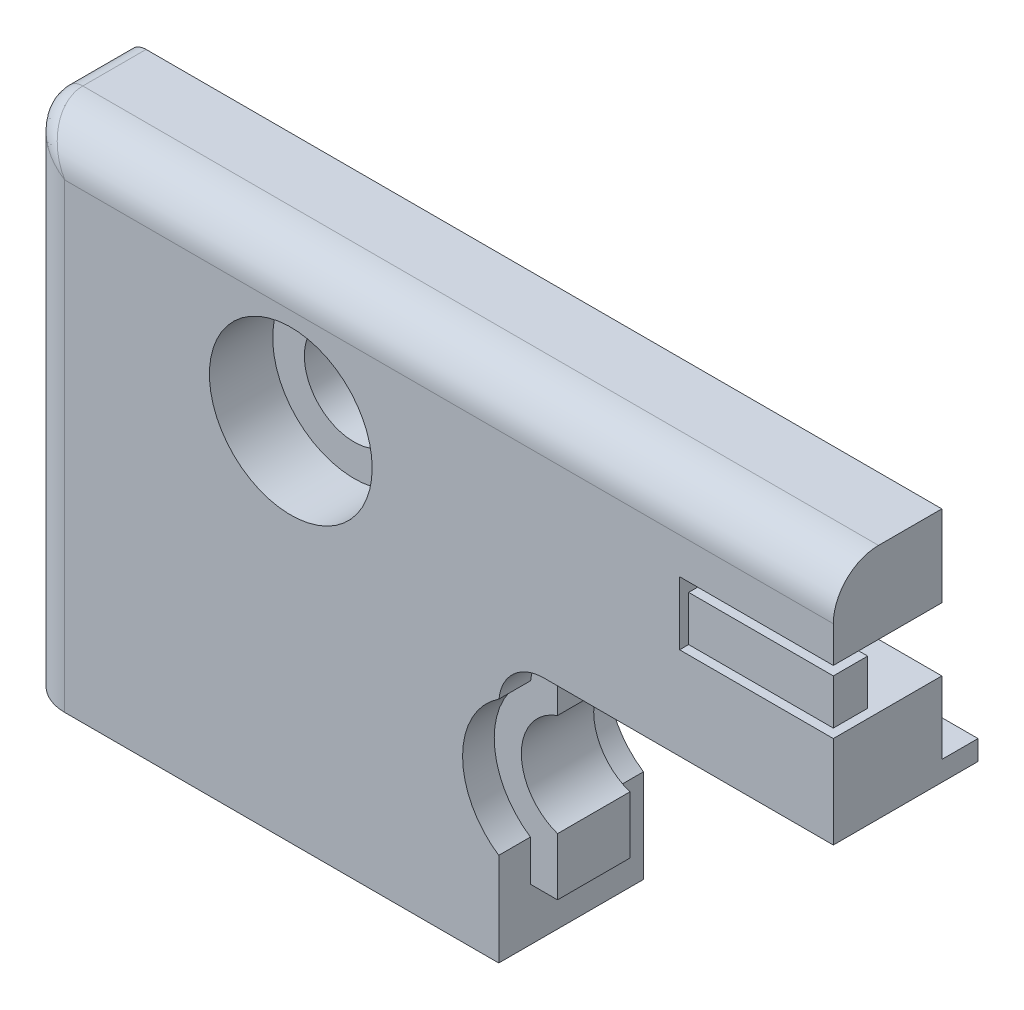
ISO-10303-21;
HEADER;
FILE_DESCRIPTION(('STEP AP214'),'2;1');
FILE_NAME('part.step','',(''),(''),'','','');
FILE_SCHEMA(('AUTOMOTIVE_DESIGN { 1 0 10303 214 1 1 1 1 }'));
ENDSEC;
DATA;
#1=APPLICATION_CONTEXT('core data for automotive mechanical design processes');
#2=APPLICATION_PROTOCOL_DEFINITION('international standard','automotive_design',2000,#1);
#3=PRODUCT_CONTEXT('',#1,'mechanical');
#4=PRODUCT('Part','Part','',(#3));
#5=PRODUCT_RELATED_PRODUCT_CATEGORY('part','',(#4));
#6=PRODUCT_DEFINITION_FORMATION('','',#4);
#7=PRODUCT_DEFINITION_CONTEXT('part definition',#1,'design');
#8=PRODUCT_DEFINITION('design','',#6,#7);
#9=PRODUCT_DEFINITION_SHAPE('','',#8);
#10=(LENGTH_UNIT() NAMED_UNIT(*) SI_UNIT(.MILLI.,.METRE.));
#11=(NAMED_UNIT(*) PLANE_ANGLE_UNIT() SI_UNIT($,.RADIAN.));
#12=(NAMED_UNIT(*) SI_UNIT($,.STERADIAN.) SOLID_ANGLE_UNIT());
#13=UNCERTAINTY_MEASURE_WITH_UNIT(LENGTH_MEASURE(1.E-05),#10,'distance_accuracy_value','');
#14=(GEOMETRIC_REPRESENTATION_CONTEXT(3) GLOBAL_UNCERTAINTY_ASSIGNED_CONTEXT((#13)) GLOBAL_UNIT_ASSIGNED_CONTEXT((#10,
#11,#12)) REPRESENTATION_CONTEXT('',''));
#15=CARTESIAN_POINT('',(0.,0.,0.));
#16=DIRECTION('',(0.,0.,1.));
#17=DIRECTION('',(1.,0.,0.));
#18=AXIS2_PLACEMENT_3D('',#15,#16,#17);
#19=CARTESIAN_POINT('',(-8.5,-1.75,8.));
#20=DIRECTION('',(0.,-1.,0.));
#21=DIRECTION('',(1.,0.,0.));
#22=AXIS2_PLACEMENT_3D('',#19,#20,#21);
#23=PLANE('',#22);
#24=DIRECTION('',(-1.,0.,0.));
#25=VECTOR('',#24,1.);
#26=CARTESIAN_POINT('',(-3.5,-1.75,6.1));
#27=LINE('',#26,#25);
#28=CARTESIAN_POINT('',(-2.5,-1.75,6.1));
#29=VERTEX_POINT('',#28);
#30=CARTESIAN_POINT('',(-3.5,-1.75,6.1));
#31=VERTEX_POINT('',#30);
#32=EDGE_CURVE('E478',#29,#31,#27,.T.);
#33=ORIENTED_EDGE('',*,*,#32,.F.);
#34=DIRECTION('',(0.,0.,-1.));
#35=VECTOR('',#34,1.);
#36=CARTESIAN_POINT('',(-2.5,-1.75,6.6));
#37=LINE('',#36,#35);
#38=CARTESIAN_POINT('',(-2.5,-1.75,6.6));
#39=VERTEX_POINT('',#38);
#40=EDGE_CURVE('E481',#39,#29,#37,.T.);
#41=ORIENTED_EDGE('',*,*,#40,.F.);
#42=DIRECTION('',(1.,0.,0.));
#43=VECTOR('',#42,1.);
#44=CARTESIAN_POINT('',(-3.5,-1.75,6.6));
#45=LINE('',#44,#43);
#46=CARTESIAN_POINT('',(-3.50000000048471,-1.75,6.6));
#47=VERTEX_POINT('',#46);
#48=EDGE_CURVE('E484',#47,#39,#45,.T.);
#49=ORIENTED_EDGE('',*,*,#48,.F.);
#50=DIRECTION('',(0.,0.,1.));
#51=VECTOR('',#50,1.);
#52=CARTESIAN_POINT('',(-3.5,-1.75,6.6));
#53=LINE('',#52,#51);
#54=EDGE_CURVE('E474',#31,#47,#53,.T.);
#55=ORIENTED_EDGE('',*,*,#54,.F.);
#56=EDGE_LOOP('',(#33,#41,#49,#55));
#57=FACE_BOUND('',#56,.T.);
#58=DIRECTION('',(-1.,0.,0.));
#59=VECTOR('',#58,1.);
#60=CARTESIAN_POINT('',(-7.,-1.75,6.1));
#61=LINE('',#60,#59);
#62=CARTESIAN_POINT('',(-6.,-1.75,6.1));
#63=VERTEX_POINT('',#62);
#64=CARTESIAN_POINT('',(-7.,-1.75,6.1));
#65=VERTEX_POINT('',#64);
#66=EDGE_CURVE('E513',#63,#65,#61,.T.);
#67=ORIENTED_EDGE('',*,*,#66,.F.);
#68=DIRECTION('',(0.,0.,-1.));
#69=VECTOR('',#68,1.);
#70=CARTESIAN_POINT('',(-6.,-1.75,6.6));
#71=LINE('',#70,#69);
#72=CARTESIAN_POINT('',(-6.,-1.75,6.6));
#73=VERTEX_POINT('',#72);
#74=EDGE_CURVE('E516',#73,#63,#71,.T.);
#75=ORIENTED_EDGE('',*,*,#74,.F.);
#76=DIRECTION('',(1.,0.,0.));
#77=VECTOR('',#76,1.);
#78=CARTESIAN_POINT('',(-7.,-1.75,6.6));
#79=LINE('',#78,#77);
#80=CARTESIAN_POINT('',(-7.0000000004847,-1.75,6.6));
#81=VERTEX_POINT('',#80);
#82=EDGE_CURVE('E519',#81,#73,#79,.T.);
#83=ORIENTED_EDGE('',*,*,#82,.F.);
#84=DIRECTION('',(0.,0.,1.));
#85=VECTOR('',#84,1.);
#86=CARTESIAN_POINT('',(-7.,-1.75,6.6));
#87=LINE('',#86,#85);
#88=EDGE_CURVE('E509',#65,#81,#87,.T.);
#89=ORIENTED_EDGE('',*,*,#88,.F.);
#90=EDGE_LOOP('',(#67,#75,#83,#89));
#91=FACE_BOUND('',#90,.T.);
#92=DIRECTION('',(1.,0.,0.));
#93=VECTOR('',#92,1.);
#94=CARTESIAN_POINT('',(-8.5,-1.75,2.));
#95=LINE('',#94,#93);
#96=CARTESIAN_POINT('',(-7.16561914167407,-1.75,2.));
#97=VERTEX_POINT('',#96);
#98=CARTESIAN_POINT('',(0.,-1.74999999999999,2.));
#99=VERTEX_POINT('',#98);
#100=EDGE_CURVE('E569',#97,#99,#95,.T.);
#101=ORIENTED_EDGE('',*,*,#100,.F.);
#102=DIRECTION('',(0.,0.,-1.));
#103=VECTOR('',#102,1.);
#104=CARTESIAN_POINT('',(-7.16561914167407,-1.75,5.8));
#105=LINE('',#104,#103);
#106=CARTESIAN_POINT('',(-7.16561914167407,-1.75,5.8));
#107=VERTEX_POINT('',#106);
#108=EDGE_CURVE('E885',#97,#107,#105,.F.);
#109=ORIENTED_EDGE('',*,*,#108,.T.);
#110=DIRECTION('',(1.,0.,0.));
#111=VECTOR('',#110,1.);
#112=CARTESIAN_POINT('',(-8.5,-1.75,5.8));
#113=LINE('',#112,#111);
#114=CARTESIAN_POINT('',(-8.5,-1.75,5.8));
#115=VERTEX_POINT('',#114);
#116=EDGE_CURVE('E53',#115,#107,#113,.T.);
#117=ORIENTED_EDGE('',*,*,#116,.F.);
#118=DIRECTION('',(0.,0.,-1.));
#119=VECTOR('',#118,1.);
#120=CARTESIAN_POINT('',(-8.5,-1.75,8.));
#121=LINE('',#120,#119);
#122=CARTESIAN_POINT('',(-8.5,-1.75,8.));
#123=VERTEX_POINT('',#122);
#124=EDGE_CURVE('E680',#123,#115,#121,.T.);
#125=ORIENTED_EDGE('',*,*,#124,.F.);
#126=DIRECTION('',(-1.,0.,0.));
#127=VECTOR('',#126,1.);
#128=CARTESIAN_POINT('',(-8.5,-1.75,8.));
#129=LINE('',#128,#127);
#130=CARTESIAN_POINT('',(0.,-1.75,8.));
#131=VERTEX_POINT('',#130);
#132=EDGE_CURVE('E645',#131,#123,#129,.T.);
#133=ORIENTED_EDGE('',*,*,#132,.F.);
#134=DIRECTION('',(0.,0.,-1.));
#135=VECTOR('',#134,1.);
#136=CARTESIAN_POINT('',(0.,-1.75,8.));
#137=LINE('',#136,#135);
#138=EDGE_CURVE('E682',#131,#99,#137,.T.);
#139=ORIENTED_EDGE('',*,*,#138,.T.);
#140=EDGE_LOOP('',(#101,#109,#117,#125,#133,#139));
#141=FACE_BOUND('',#140,.T.);
#142=ADVANCED_FACE('F32',(#57,#91,#141),#23,.F.);
#143=CARTESIAN_POINT('',(-8.5,1.75,8.));
#144=DIRECTION('',(-1.,0.,0.));
#145=DIRECTION('',(0.,0.,1.));
#146=AXIS2_PLACEMENT_3D('',#143,#144,#145);
#147=PLANE('',#146);
#148=DIRECTION('',(0.,-1.,0.));
#149=VECTOR('',#148,1.);
#150=CARTESIAN_POINT('',(-8.5,1.75,5.8));
#151=LINE('',#150,#149);
#152=CARTESIAN_POINT('',(-8.5,1.75,5.8));
#153=VERTEX_POINT('',#152);
#154=EDGE_CURVE('E47',#153,#115,#151,.T.);
#155=ORIENTED_EDGE('',*,*,#154,.F.);
#156=DIRECTION('',(0.,0.,-1.));
#157=VECTOR('',#156,1.);
#158=CARTESIAN_POINT('',(-8.5,1.75,8.));
#159=LINE('',#158,#157);
#160=CARTESIAN_POINT('',(-8.5,1.75,8.));
#161=VERTEX_POINT('',#160);
#162=EDGE_CURVE('E677',#161,#153,#159,.T.);
#163=ORIENTED_EDGE('',*,*,#162,.F.);
#164=DIRECTION('',(0.,1.,0.));
#165=VECTOR('',#164,1.);
#166=CARTESIAN_POINT('',(-8.5,1.75,8.));
#167=LINE('',#166,#165);
#168=EDGE_CURVE('E647',#123,#161,#167,.T.);
#169=ORIENTED_EDGE('',*,*,#168,.F.);
#170=ORIENTED_EDGE('',*,*,#124,.T.);
#171=EDGE_LOOP('',(#155,#163,#169,#170));
#172=FACE_BOUND('',#171,.T.);
#173=ADVANCED_FACE('F771',(#172),#147,.F.);
#174=CARTESIAN_POINT('',(-16.,-9.35000000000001,0.));
#175=DIRECTION('',(0.,0.,1.));
#176=DIRECTION('',(1.,0.,0.));
#177=AXIS2_PLACEMENT_3D('',#174,#175,#176);
#178=PLANE('',#177);
#179=DIRECTION('',(-1.,0.,0.));
#180=VECTOR('',#179,1.);
#181=CARTESIAN_POINT('',(0.,-5.75000000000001,0.));
#182=LINE('',#181,#180);
#183=CARTESIAN_POINT('',(-15.7911012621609,-5.75000000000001,0.));
#184=VERTEX_POINT('',#183);
#185=CARTESIAN_POINT('',(-45.,-5.75000000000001,0.));
#186=VERTEX_POINT('',#185);
#187=EDGE_CURVE('E564',#184,#186,#182,.T.);
#188=ORIENTED_EDGE('',*,*,#187,.F.);
#189=CARTESIAN_POINT('',(-16.75,-6.0337484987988,0.));
#190=DIRECTION('',(0.,0.,1.));
#191=DIRECTION('',(1.,0.,0.));
#192=AXIS2_PLACEMENT_3D('',#189,#190,#191);
#193=CIRCLE('',#192,1.);
#194=CARTESIAN_POINT('',(-15.75,-6.0337484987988,0.));
#195=VERTEX_POINT('',#194);
#196=EDGE_CURVE('E867',#184,#195,#193,.F.);
#197=ORIENTED_EDGE('',*,*,#196,.T.);
#198=DIRECTION('',(0.,1.,0.));
#199=VECTOR('',#198,1.);
#200=CARTESIAN_POINT('',(-15.75,-9.35000000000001,0.));
#201=LINE('',#200,#199);
#202=CARTESIAN_POINT('',(-15.75,-6.85,0.));
#203=VERTEX_POINT('',#202);
#204=EDGE_CURVE('E407',#203,#195,#201,.T.);
#205=ORIENTED_EDGE('',*,*,#204,.F.);
#206=DIRECTION('',(1.,0.,0.));
#207=VECTOR('',#206,1.);
#208=CARTESIAN_POINT('',(0.,-6.85,0.));
#209=LINE('',#208,#207);
#210=CARTESIAN_POINT('',(-16.,-6.85,0.));
#211=VERTEX_POINT('',#210);
#212=EDGE_CURVE('E662',#211,#203,#209,.T.);
#213=ORIENTED_EDGE('',*,*,#212,.F.);
#214=CARTESIAN_POINT('',(-16.,-9.35000000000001,0.));
#215=DIRECTION('',(0.,0.,-1.));
#216=DIRECTION('',(1.,0.,0.));
#217=AXIS2_PLACEMENT_3D('',#214,#215,#216);
#218=CIRCLE('',#217,2.5);
#219=CARTESIAN_POINT('',(-18.4874685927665,-9.1,0.));
#220=VERTEX_POINT('',#219);
#221=EDGE_CURVE('E659',#220,#211,#218,.T.);
#222=ORIENTED_EDGE('',*,*,#221,.F.);
#223=CARTESIAN_POINT('',(-16.,-12.85,0.));
#224=DIRECTION('',(0.,0.,-1.));
#225=DIRECTION('',(-1.,0.,0.));
#226=AXIS2_PLACEMENT_3D('',#223,#224,#225);
#227=CIRCLE('',#226,4.5);
#228=CARTESIAN_POINT('',(-18.5,-16.5916573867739,0.));
#229=VERTEX_POINT('',#228);
#230=EDGE_CURVE('E584',#229,#220,#227,.T.);
#231=ORIENTED_EDGE('',*,*,#230,.F.);
#232=DIRECTION('',(0.,1.,0.));
#233=VECTOR('',#232,1.);
#234=CARTESIAN_POINT('',(-18.5,-18.85,0.));
#235=LINE('',#234,#233);
#236=CARTESIAN_POINT('',(-18.5,-21.75,0.));
#237=VERTEX_POINT('',#236);
#238=EDGE_CURVE('E657',#237,#229,#235,.T.);
#239=ORIENTED_EDGE('',*,*,#238,.F.);
#240=DIRECTION('',(1.,0.,0.));
#241=VECTOR('',#240,1.);
#242=CARTESIAN_POINT('',(-18.5,-21.75,0.));
#243=LINE('',#242,#241);
#244=CARTESIAN_POINT('',(-45.,-21.75,0.));
#245=VERTEX_POINT('',#244);
#246=EDGE_CURVE('E631',#245,#237,#243,.T.);
#247=ORIENTED_EDGE('',*,*,#246,.F.);
#248=DIRECTION('',(0.,-1.,0.));
#249=VECTOR('',#248,1.);
#250=CARTESIAN_POINT('',(-45.,-21.75,0.));
#251=LINE('',#250,#249);
#252=EDGE_CURVE('E637',#186,#245,#251,.T.);
#253=ORIENTED_EDGE('',*,*,#252,.F.);
#254=EDGE_LOOP('',(#188,#197,#205,#213,#222,#231,#239,#247,#253));
#255=FACE_BOUND('',#254,.T.);
#256=ADVANCED_FACE('F777',(#255),#178,.F.);
#257=DIRECTION('',(0.,-1.,0.));
#258=VECTOR('',#257,1.);
#259=CARTESIAN_POINT('',(-10.25,-9.35000000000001,0.));
#260=LINE('',#259,#258);
#261=CARTESIAN_POINT('',(-10.25,-6.03374849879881,0.));
#262=VERTEX_POINT('',#261);
#263=CARTESIAN_POINT('',(-10.25,-6.85000000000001,0.));
#264=VERTEX_POINT('',#263);
#265=EDGE_CURVE('E395',#262,#264,#260,.T.);
#266=ORIENTED_EDGE('',*,*,#265,.F.);
#267=CARTESIAN_POINT('',(-9.25,-6.03374849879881,0.));
#268=DIRECTION('',(0.,0.,1.));
#269=DIRECTION('',(1.,0.,0.));
#270=AXIS2_PLACEMENT_3D('',#267,#268,#269);
#271=CIRCLE('',#270,1.);
#272=CARTESIAN_POINT('',(-10.2088987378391,-5.75000000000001,0.));
#273=VERTEX_POINT('',#272);
#274=EDGE_CURVE('E877',#262,#273,#271,.F.);
#275=ORIENTED_EDGE('',*,*,#274,.T.);
#276=CARTESIAN_POINT('',(0.,-5.75000000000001,0.));
#277=VERTEX_POINT('',#276);
#278=EDGE_CURVE('E561',#277,#273,#182,.T.);
#279=ORIENTED_EDGE('',*,*,#278,.F.);
#280=DIRECTION('',(0.,1.,0.));
#281=VECTOR('',#280,1.);
#282=CARTESIAN_POINT('',(0.,-1.75,0.));
#283=LINE('',#282,#281);
#284=CARTESIAN_POINT('',(0.,-6.85,0.));
#285=VERTEX_POINT('',#284);
#286=EDGE_CURVE('E664',#285,#277,#283,.T.);
#287=ORIENTED_EDGE('',*,*,#286,.F.);
#288=EDGE_CURVE('E661',#264,#285,#209,.T.);
#289=ORIENTED_EDGE('',*,*,#288,.F.);
#290=EDGE_LOOP('',(#266,#275,#279,#287,#289));
#291=FACE_BOUND('',#290,.T.);
#292=ADVANCED_FACE('F792',(#291),#178,.F.);
#293=CARTESIAN_POINT('',(0.,-6.85,8.));
#294=DIRECTION('',(0.,1.,0.));
#295=DIRECTION('',(-1.,0.,0.));
#296=AXIS2_PLACEMENT_3D('',#293,#294,#295);
#297=PLANE('',#296);
#298=DIRECTION('',(0.,0.,1.));
#299=VECTOR('',#298,1.);
#300=CARTESIAN_POINT('',(-15.75,-6.85,-1.5));
#301=LINE('',#300,#299);
#302=CARTESIAN_POINT('',(-15.75,-6.85,5.8));
#303=VERTEX_POINT('',#302);
#304=EDGE_CURVE('E398',#203,#303,#301,.T.);
#305=ORIENTED_EDGE('',*,*,#304,.T.);
#306=DIRECTION('',(-1.,0.,0.));
#307=VECTOR('',#306,1.);
#308=CARTESIAN_POINT('',(-15.75,-6.85,5.8));
#309=LINE('',#308,#307);
#310=CARTESIAN_POINT('',(-10.25,-6.85000000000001,5.8));
#311=VERTEX_POINT('',#310);
#312=EDGE_CURVE('E383',#311,#303,#309,.T.);
#313=ORIENTED_EDGE('',*,*,#312,.F.);
#314=DIRECTION('',(0.,0.,1.));
#315=VECTOR('',#314,1.);
#316=CARTESIAN_POINT('',(-10.25,-6.85000000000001,-1.5));
#317=LINE('',#316,#315);
#318=EDGE_CURVE('E392',#264,#311,#317,.T.);
#319=ORIENTED_EDGE('',*,*,#318,.F.);
#320=ORIENTED_EDGE('',*,*,#288,.T.);
#321=DIRECTION('',(0.,0.,-1.));
#322=VECTOR('',#321,1.);
#323=CARTESIAN_POINT('',(0.,-6.85,8.));
#324=LINE('',#323,#322);
#325=CARTESIAN_POINT('',(0.,-6.85,8.));
#326=VERTEX_POINT('',#325);
#327=EDGE_CURVE('E685',#326,#285,#324,.T.);
#328=ORIENTED_EDGE('',*,*,#327,.F.);
#329=DIRECTION('',(1.,0.,0.));
#330=VECTOR('',#329,1.);
#331=CARTESIAN_POINT('',(0.,-6.85,8.));
#332=LINE('',#331,#330);
#333=CARTESIAN_POINT('',(-16.,-6.85,8.));
#334=VERTEX_POINT('',#333);
#335=EDGE_CURVE('E641',#334,#326,#332,.T.);
#336=ORIENTED_EDGE('',*,*,#335,.F.);
#337=DIRECTION('',(0.,0.,-1.));
#338=VECTOR('',#337,1.);
#339=CARTESIAN_POINT('',(-16.,-6.85,8.));
#340=LINE('',#339,#338);
#341=EDGE_CURVE('E688',#334,#211,#340,.T.);
#342=ORIENTED_EDGE('',*,*,#341,.T.);
#343=ORIENTED_EDGE('',*,*,#212,.T.);
#344=EDGE_LOOP('',(#305,#313,#319,#320,#328,#336,#342,#343));
#345=FACE_BOUND('',#344,.T.);
#346=ADVANCED_FACE('F400',(#345),#297,.F.);
#347=CARTESIAN_POINT('',(0.,-30.0864940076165,2.));
#348=DIRECTION('',(0.,0.,-1.));
#349=DIRECTION('',(0.,1.,0.));
#350=AXIS2_PLACEMENT_3D('',#347,#348,#349);
#351=PLANE('',#350);
#352=CARTESIAN_POINT('',(-30.,-1.55,2.));
#353=DIRECTION('',(0.,0.,-1.));
#354=DIRECTION('',(0.,1.,0.));
#355=AXIS2_PLACEMENT_3D('',#352,#353,#354);
#356=CIRCLE('',#355,2.75);
#357=CARTESIAN_POINT('',(-30.,1.2,2.));
#358=VERTEX_POINT('',#357);
#359=EDGE_CURVE('E571',#358,#358,#356,.T.);
#360=ORIENTED_EDGE('',*,*,#359,.F.);
#361=EDGE_LOOP('',(#360));
#362=FACE_BOUND('',#361,.T.);
#363=CARTESIAN_POINT('',(-13.,-1.35000000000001,2.));
#364=DIRECTION('',(0.,0.,-1.));
#365=DIRECTION('',(0.,1.,0.));
#366=AXIS2_PLACEMENT_3D('',#363,#364,#365);
#367=CIRCLE('',#366,5.);
#368=CARTESIAN_POINT('',(-9.34444904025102,2.06129699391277,2.));
#369=VERTEX_POINT('',#368);
#370=CARTESIAN_POINT('',(-16.125,-5.25312374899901,2.));
#371=VERTEX_POINT('',#370);
#372=EDGE_CURVE('E916',#369,#371,#367,.F.);
#373=ORIENTED_EDGE('',*,*,#372,.T.);
#374=CARTESIAN_POINT('',(-16.75,-6.0337484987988,2.));
#375=DIRECTION('',(0.,0.,-1.));
#376=DIRECTION('',(0.,1.,0.));
#377=AXIS2_PLACEMENT_3D('',#374,#375,#376);
#378=CIRCLE('',#377,1.);
#379=CARTESIAN_POINT('',(-15.7911012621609,-5.75000000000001,2.));
#380=VERTEX_POINT('',#379);
#381=EDGE_CURVE('E858',#371,#380,#378,.T.);
#382=ORIENTED_EDGE('',*,*,#381,.T.);
#383=DIRECTION('',(-1.,0.,0.));
#384=VECTOR('',#383,1.);
#385=CARTESIAN_POINT('',(0.,-5.75000000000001,2.));
#386=LINE('',#385,#384);
#387=CARTESIAN_POINT('',(-45.,-5.75000000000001,2.));
#388=VERTEX_POINT('',#387);
#389=EDGE_CURVE('E560',#380,#388,#386,.T.);
#390=ORIENTED_EDGE('',*,*,#389,.T.);
#391=DIRECTION('',(0.,-1.,0.));
#392=VECTOR('',#391,1.);
#393=CARTESIAN_POINT('',(-45.,-30.0864940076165,2.));
#394=LINE('',#393,#392);
#395=CARTESIAN_POINT('',(-45.,5.24999999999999,2.));
#396=VERTEX_POINT('',#395);
#397=EDGE_CURVE('E512',#396,#388,#394,.T.);
#398=ORIENTED_EDGE('',*,*,#397,.F.);
#399=CARTESIAN_POINT('',(-44.,5.24999999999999,2.));
#400=DIRECTION('',(0.,0.,-1.));
#401=DIRECTION('',(0.,1.,0.));
#402=AXIS2_PLACEMENT_3D('',#399,#400,#401);
#403=CIRCLE('',#402,1.);
#404=CARTESIAN_POINT('',(-44.,6.24999999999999,2.));
#405=VERTEX_POINT('',#404);
#406=EDGE_CURVE('E730',#405,#396,#403,.F.);
#407=ORIENTED_EDGE('',*,*,#406,.F.);
#408=DIRECTION('',(-1.,0.,0.));
#409=VECTOR('',#408,1.);
#410=CARTESIAN_POINT('',(0.,6.24999999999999,2.));
#411=LINE('',#410,#409);
#412=CARTESIAN_POINT('',(0.,6.24999999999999,2.));
#413=VERTEX_POINT('',#412);
#414=EDGE_CURVE('E550',#413,#405,#411,.T.);
#415=ORIENTED_EDGE('',*,*,#414,.F.);
#416=DIRECTION('',(0.,-1.,0.));
#417=VECTOR('',#416,1.);
#418=CARTESIAN_POINT('',(0.,-30.0864940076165,2.));
#419=LINE('',#418,#417);
#420=CARTESIAN_POINT('',(0.,1.74999999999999,2.));
#421=VERTEX_POINT('',#420);
#422=EDGE_CURVE('E544',#413,#421,#419,.T.);
#423=ORIENTED_EDGE('',*,*,#422,.T.);
#424=DIRECTION('',(-1.,0.,0.));
#425=VECTOR('',#424,1.);
#426=CARTESIAN_POINT('',(0.,1.75,2.));
#427=LINE('',#426,#425);
#428=CARTESIAN_POINT('',(-8.5,1.75,2.));
#429=VERTEX_POINT('',#428);
#430=EDGE_CURVE('E559',#421,#429,#427,.T.);
#431=ORIENTED_EDGE('',*,*,#430,.T.);
#432=CARTESIAN_POINT('',(-8.61333884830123,2.74355639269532,2.));
#433=DIRECTION('',(0.,0.,-1.));
#434=DIRECTION('',(0.,1.,0.));
#435=AXIS2_PLACEMENT_3D('',#432,#433,#434);
#436=CIRCLE('',#435,1.);
#437=EDGE_CURVE('E853',#429,#369,#436,.T.);
#438=ORIENTED_EDGE('',*,*,#437,.T.);
#439=EDGE_LOOP('',(#373,#382,#390,#398,#407,#415,#423,#431,#438));
#440=FACE_BOUND('',#439,.T.);
#441=ADVANCED_FACE('F791',(#362,#440),#351,.T.);
#442=CARTESIAN_POINT('',(0.,-5.75000000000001,2.));
#443=VERTEX_POINT('',#442);
#444=CARTESIAN_POINT('',(-10.2088987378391,-5.75000000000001,2.));
#445=VERTEX_POINT('',#444);
#446=EDGE_CURVE('E556',#443,#445,#386,.T.);
#447=ORIENTED_EDGE('',*,*,#446,.T.);
#448=CARTESIAN_POINT('',(-9.25,-6.03374849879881,2.));
#449=DIRECTION('',(0.,0.,-1.));
#450=DIRECTION('',(0.,1.,0.));
#451=AXIS2_PLACEMENT_3D('',#448,#449,#450);
#452=CIRCLE('',#451,1.);
#453=CARTESIAN_POINT('',(-9.875,-5.25312374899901,2.));
#454=VERTEX_POINT('',#453);
#455=EDGE_CURVE('E883',#445,#454,#452,.T.);
#456=ORIENTED_EDGE('',*,*,#455,.T.);
#457=CARTESIAN_POINT('',(-8.13801595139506,-2.51666666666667,2.));
#458=VERTEX_POINT('',#457);
#459=EDGE_CURVE('E903',#454,#458,#367,.F.);
#460=ORIENTED_EDGE('',*,*,#459,.T.);
#461=CARTESIAN_POINT('',(-7.16561914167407,-2.75,2.));
#462=DIRECTION('',(0.,0.,-1.));
#463=DIRECTION('',(0.,1.,0.));
#464=AXIS2_PLACEMENT_3D('',#461,#462,#463);
#465=CIRCLE('',#464,1.);
#466=EDGE_CURVE('E881',#458,#97,#465,.T.);
#467=ORIENTED_EDGE('',*,*,#466,.T.);
#468=ORIENTED_EDGE('',*,*,#100,.T.);
#469=EDGE_CURVE('E547',#99,#443,#419,.T.);
#470=ORIENTED_EDGE('',*,*,#469,.T.);
#471=EDGE_LOOP('',(#447,#456,#460,#467,#468,#470));
#472=FACE_BOUND('',#471,.T.);
#473=ADVANCED_FACE('F901',(#472),#351,.T.);
#474=CARTESIAN_POINT('',(0.,-5.75000000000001,2.75));
#475=DIRECTION('',(0.,-1.,0.));
#476=DIRECTION('',(0.,0.,-1.));
#477=AXIS2_PLACEMENT_3D('',#474,#475,#476);
#478=PLANE('',#477);
#479=ORIENTED_EDGE('',*,*,#389,.F.);
#480=DIRECTION('',(0.,0.,1.));
#481=VECTOR('',#480,1.);
#482=CARTESIAN_POINT('',(-15.7911012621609,-5.75000000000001,2.));
#483=LINE('',#482,#481);
#484=EDGE_CURVE('E861',#380,#184,#483,.F.);
#485=ORIENTED_EDGE('',*,*,#484,.T.);
#486=ORIENTED_EDGE('',*,*,#187,.T.);
#487=DIRECTION('',(0.,0.,1.));
#488=VECTOR('',#487,1.);
#489=CARTESIAN_POINT('',(-45.,-5.75000000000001,2.75));
#490=LINE('',#489,#488);
#491=EDGE_CURVE('E553',#186,#388,#490,.T.);
#492=ORIENTED_EDGE('',*,*,#491,.T.);
#493=EDGE_LOOP('',(#479,#485,#486,#492));
#494=FACE_BOUND('',#493,.T.);
#495=ADVANCED_FACE('F940',(#494),#478,.F.);
#496=ORIENTED_EDGE('',*,*,#278,.T.);
#497=DIRECTION('',(0.,0.,1.));
#498=VECTOR('',#497,1.);
#499=CARTESIAN_POINT('',(-10.2088987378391,-5.75000000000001,0.));
#500=LINE('',#499,#498);
#501=EDGE_CURVE('E879',#273,#445,#500,.T.);
#502=ORIENTED_EDGE('',*,*,#501,.T.);
#503=ORIENTED_EDGE('',*,*,#446,.F.);
#504=DIRECTION('',(0.,0.,1.));
#505=VECTOR('',#504,1.);
#506=CARTESIAN_POINT('',(0.,-5.75000000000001,2.75));
#507=LINE('',#506,#505);
#508=EDGE_CURVE('E546',#277,#443,#507,.T.);
#509=ORIENTED_EDGE('',*,*,#508,.F.);
#510=EDGE_LOOP('',(#496,#502,#503,#509));
#511=FACE_BOUND('',#510,.T.);
#512=ADVANCED_FACE('F912',(#511),#478,.F.);
#513=CARTESIAN_POINT('',(-6.0000000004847,500000.,6.6));
#514=DIRECTION('',(-1.,0.,0.));
#515=DIRECTION('',(0.,-1.,0.));
#516=AXIS2_PLACEMENT_3D('',#513,#514,#515);
#517=PLANE('',#516);
#518=DIRECTION('',(0.,0.,-1.));
#519=VECTOR('',#518,1.);
#520=CARTESIAN_POINT('',(-6.,-1.25000000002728,6.60000000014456));
#521=LINE('',#520,#519);
#522=CARTESIAN_POINT('',(-6.,-1.25000000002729,6.6));
#523=VERTEX_POINT('',#522);
#524=CARTESIAN_POINT('',(-6.,-1.25000000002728,6.1));
#525=VERTEX_POINT('',#524);
#526=EDGE_CURVE('E460',#523,#525,#521,.T.);
#527=ORIENTED_EDGE('',*,*,#526,.F.);
#528=DIRECTION('',(0.,-1.,0.));
#529=VECTOR('',#528,1.);
#530=CARTESIAN_POINT('',(-6.0000000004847,500000.,6.6));
#531=LINE('',#530,#529);
#532=EDGE_CURVE('E526',#523,#73,#531,.T.);
#533=ORIENTED_EDGE('',*,*,#532,.T.);
#534=ORIENTED_EDGE('',*,*,#74,.T.);
#535=DIRECTION('',(0.,-1.,0.));
#536=VECTOR('',#535,1.);
#537=CARTESIAN_POINT('',(-6.0000000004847,500000.,6.1));
#538=LINE('',#537,#536);
#539=EDGE_CURVE('E531',#525,#63,#538,.T.);
#540=ORIENTED_EDGE('',*,*,#539,.F.);
#541=EDGE_LOOP('',(#527,#533,#534,#540));
#542=FACE_BOUND('',#541,.T.);
#543=ADVANCED_FACE('F1194',(#542),#517,.F.);
#544=CARTESIAN_POINT('',(-7.0000000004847,500000.,6.6));
#545=DIRECTION('',(1.,0.,0.));
#546=DIRECTION('',(0.,1.,0.));
#547=AXIS2_PLACEMENT_3D('',#544,#545,#546);
#548=PLANE('',#547);
#549=DIRECTION('',(0.,0.,1.));
#550=VECTOR('',#549,1.);
#551=CARTESIAN_POINT('',(-7.,-1.25000000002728,6.60000000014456));
#552=LINE('',#551,#550);
#553=CARTESIAN_POINT('',(-7.,-1.25000000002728,6.1));
#554=VERTEX_POINT('',#553);
#555=CARTESIAN_POINT('',(-7.,-1.25000000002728,6.6));
#556=VERTEX_POINT('',#555);
#557=EDGE_CURVE('E457',#554,#556,#552,.T.);
#558=ORIENTED_EDGE('',*,*,#557,.F.);
#559=DIRECTION('',(0.,-1.,0.));
#560=VECTOR('',#559,1.);
#561=CARTESIAN_POINT('',(-7.0000000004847,500000.,6.1));
#562=LINE('',#561,#560);
#563=EDGE_CURVE('E535',#554,#65,#562,.T.);
#564=ORIENTED_EDGE('',*,*,#563,.T.);
#565=ORIENTED_EDGE('',*,*,#88,.T.);
#566=DIRECTION('',(0.,-1.,0.));
#567=VECTOR('',#566,1.);
#568=CARTESIAN_POINT('',(-7.0000000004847,500000.,6.6));
#569=LINE('',#568,#567);
#570=EDGE_CURVE('E527',#556,#81,#569,.T.);
#571=ORIENTED_EDGE('',*,*,#570,.F.);
#572=EDGE_LOOP('',(#558,#564,#565,#571));
#573=FACE_BOUND('',#572,.T.);
#574=ADVANCED_FACE('F1052',(#573),#548,.F.);
#575=CARTESIAN_POINT('',(-7.0000000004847,500000.,6.6));
#576=DIRECTION('',(0.,0.,-1.));
#577=DIRECTION('',(-1.,0.,0.));
#578=AXIS2_PLACEMENT_3D('',#575,#576,#577);
#579=PLANE('',#578);
#580=DIRECTION('',(1.,0.,0.));
#581=VECTOR('',#580,1.);
#582=CARTESIAN_POINT('',(-7.00000000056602,-1.25000000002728,6.6));
#583=LINE('',#582,#581);
#584=EDGE_CURVE('E454',#556,#523,#583,.T.);
#585=ORIENTED_EDGE('',*,*,#584,.F.);
#586=ORIENTED_EDGE('',*,*,#570,.T.);
#587=ORIENTED_EDGE('',*,*,#82,.T.);
#588=ORIENTED_EDGE('',*,*,#532,.F.);
#589=EDGE_LOOP('',(#585,#586,#587,#588));
#590=FACE_BOUND('',#589,.T.);
#591=ADVANCED_FACE('F1043',(#590),#579,.F.);
#592=CARTESIAN_POINT('',(-2.5000000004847,500000.,6.6));
#593=DIRECTION('',(-1.,0.,0.));
#594=DIRECTION('',(0.,-1.,0.));
#595=AXIS2_PLACEMENT_3D('',#592,#593,#594);
#596=PLANE('',#595);
#597=DIRECTION('',(0.,0.,-1.));
#598=VECTOR('',#597,1.);
#599=CARTESIAN_POINT('',(-2.5,-1.25000000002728,6.60000000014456));
#600=LINE('',#599,#598);
#601=CARTESIAN_POINT('',(-2.5,-1.25000000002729,6.6));
#602=VERTEX_POINT('',#601);
#603=CARTESIAN_POINT('',(-2.5,-1.25000000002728,6.1));
#604=VERTEX_POINT('',#603);
#605=EDGE_CURVE('E451',#602,#604,#600,.T.);
#606=ORIENTED_EDGE('',*,*,#605,.F.);
#607=DIRECTION('',(0.,-1.,0.));
#608=VECTOR('',#607,1.);
#609=CARTESIAN_POINT('',(-2.5000000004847,500000.,6.6));
#610=LINE('',#609,#608);
#611=EDGE_CURVE('E491',#602,#39,#610,.T.);
#612=ORIENTED_EDGE('',*,*,#611,.T.);
#613=ORIENTED_EDGE('',*,*,#40,.T.);
#614=DIRECTION('',(0.,-1.,0.));
#615=VECTOR('',#614,1.);
#616=CARTESIAN_POINT('',(-2.5000000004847,500000.,6.1));
#617=LINE('',#616,#615);
#618=EDGE_CURVE('E496',#604,#29,#617,.T.);
#619=ORIENTED_EDGE('',*,*,#618,.F.);
#620=EDGE_LOOP('',(#606,#612,#613,#619));
#621=FACE_BOUND('',#620,.T.);
#622=ADVANCED_FACE('F1041',(#621),#596,.F.);
#623=CARTESIAN_POINT('',(-3.5000000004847,500000.,6.6));
#624=DIRECTION('',(1.,0.,0.));
#625=DIRECTION('',(0.,1.,0.));
#626=AXIS2_PLACEMENT_3D('',#623,#624,#625);
#627=PLANE('',#626);
#628=DIRECTION('',(0.,0.,1.));
#629=VECTOR('',#628,1.);
#630=CARTESIAN_POINT('',(-3.5,-1.25000000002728,6.60000000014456));
#631=LINE('',#630,#629);
#632=CARTESIAN_POINT('',(-3.5,-1.25000000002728,6.1));
#633=VERTEX_POINT('',#632);
#634=CARTESIAN_POINT('',(-3.5,-1.25000000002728,6.6));
#635=VERTEX_POINT('',#634);
#636=EDGE_CURVE('E440',#633,#635,#631,.T.);
#637=ORIENTED_EDGE('',*,*,#636,.F.);
#638=DIRECTION('',(0.,-1.,0.));
#639=VECTOR('',#638,1.);
#640=CARTESIAN_POINT('',(-3.5000000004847,500000.,6.1));
#641=LINE('',#640,#639);
#642=EDGE_CURVE('E500',#633,#31,#641,.T.);
#643=ORIENTED_EDGE('',*,*,#642,.T.);
#644=ORIENTED_EDGE('',*,*,#54,.T.);
#645=DIRECTION('',(0.,-1.,0.));
#646=VECTOR('',#645,1.);
#647=CARTESIAN_POINT('',(-3.5000000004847,500000.,6.6));
#648=LINE('',#647,#646);
#649=EDGE_CURVE('E492',#635,#47,#648,.T.);
#650=ORIENTED_EDGE('',*,*,#649,.F.);
#651=EDGE_LOOP('',(#637,#643,#644,#650));
#652=FACE_BOUND('',#651,.T.);
#653=ADVANCED_FACE('F980',(#652),#627,.F.);
#654=CARTESIAN_POINT('',(-3.5000000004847,500000.,6.6));
#655=DIRECTION('',(0.,0.,-1.));
#656=DIRECTION('',(-1.,0.,0.));
#657=AXIS2_PLACEMENT_3D('',#654,#655,#656);
#658=PLANE('',#657);
#659=DIRECTION('',(1.,0.,0.));
#660=VECTOR('',#659,1.);
#661=CARTESIAN_POINT('',(-3.50000000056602,-1.25000000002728,6.6));
#662=LINE('',#661,#660);
#663=EDGE_CURVE('E920',#635,#602,#662,.T.);
#664=ORIENTED_EDGE('',*,*,#663,.F.);
#665=ORIENTED_EDGE('',*,*,#649,.T.);
#666=ORIENTED_EDGE('',*,*,#48,.T.);
#667=ORIENTED_EDGE('',*,*,#611,.F.);
#668=EDGE_LOOP('',(#664,#665,#666,#667));
#669=FACE_BOUND('',#668,.T.);
#670=ADVANCED_FACE('F973',(#669),#658,.F.);
#671=CARTESIAN_POINT('',(0.,1.75,8.));
#672=DIRECTION('',(0.,1.,0.));
#673=DIRECTION('',(0.,0.,1.));
#674=AXIS2_PLACEMENT_3D('',#671,#672,#673);
#675=PLANE('',#674);
#676=DIRECTION('',(-1.,0.,0.));
#677=VECTOR('',#676,1.);
#678=CARTESIAN_POINT('',(-7.0000000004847,1.75000000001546,6.1));
#679=LINE('',#678,#677);
#680=CARTESIAN_POINT('',(-6.,1.75,6.1));
#681=VERTEX_POINT('',#680);
#682=CARTESIAN_POINT('',(-7.,1.75,6.1));
#683=VERTEX_POINT('',#682);
#684=EDGE_CURVE('E477',#681,#683,#679,.T.);
#685=ORIENTED_EDGE('',*,*,#684,.T.);
#686=DIRECTION('',(0.,0.,1.));
#687=VECTOR('',#686,1.);
#688=CARTESIAN_POINT('',(-7.,1.75000000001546,6.6));
#689=LINE('',#688,#687);
#690=CARTESIAN_POINT('',(-7.,1.75000000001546,6.6));
#691=VERTEX_POINT('',#690);
#692=EDGE_CURVE('E537',#683,#691,#689,.T.);
#693=ORIENTED_EDGE('',*,*,#692,.T.);
#694=DIRECTION('',(1.,0.,0.));
#695=VECTOR('',#694,1.);
#696=CARTESIAN_POINT('',(-7.0000000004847,1.75000000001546,6.6));
#697=LINE('',#696,#695);
#698=CARTESIAN_POINT('',(-6.,1.75,6.6));
#699=VERTEX_POINT('',#698);
#700=EDGE_CURVE('E539',#691,#699,#697,.T.);
#701=ORIENTED_EDGE('',*,*,#700,.T.);
#702=DIRECTION('',(0.,0.,-1.));
#703=VECTOR('',#702,1.);
#704=CARTESIAN_POINT('',(-6.,1.75000000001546,6.6));
#705=LINE('',#704,#703);
#706=EDGE_CURVE('E541',#699,#681,#705,.T.);
#707=ORIENTED_EDGE('',*,*,#706,.T.);
#708=EDGE_LOOP('',(#685,#693,#701,#707));
#709=FACE_BOUND('',#708,.T.);
#710=ORIENTED_EDGE('',*,*,#430,.F.);
#711=DIRECTION('',(0.,0.,-1.));
#712=VECTOR('',#711,1.);
#713=CARTESIAN_POINT('',(0.,1.75,8.));
#714=LINE('',#713,#712);
#715=CARTESIAN_POINT('',(0.,1.75,8.));
#716=VERTEX_POINT('',#715);
#717=EDGE_CURVE('E673',#716,#421,#714,.T.);
#718=ORIENTED_EDGE('',*,*,#717,.F.);
#719=DIRECTION('',(1.,0.,0.));
#720=VECTOR('',#719,1.);
#721=CARTESIAN_POINT('',(0.,1.75,8.));
#722=LINE('',#721,#720);
#723=EDGE_CURVE('E649',#161,#716,#722,.T.);
#724=ORIENTED_EDGE('',*,*,#723,.F.);
#725=ORIENTED_EDGE('',*,*,#162,.T.);
#726=EDGE_CURVE('E676',#153,#429,#159,.T.);
#727=ORIENTED_EDGE('',*,*,#726,.T.);
#728=EDGE_LOOP('',(#710,#718,#724,#725,#727));
#729=FACE_BOUND('',#728,.T.);
#730=DIRECTION('',(-1.,0.,0.));
#731=VECTOR('',#730,1.);
#732=CARTESIAN_POINT('',(-3.5000000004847,1.75000000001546,6.1));
#733=LINE('',#732,#731);
#734=CARTESIAN_POINT('',(-2.5,1.75,6.1));
#735=VERTEX_POINT('',#734);
#736=CARTESIAN_POINT('',(-3.5,1.75,6.1));
#737=VERTEX_POINT('',#736);
#738=EDGE_CURVE('E473',#735,#737,#733,.T.);
#739=ORIENTED_EDGE('',*,*,#738,.T.);
#740=DIRECTION('',(0.,0.,1.));
#741=VECTOR('',#740,1.);
#742=CARTESIAN_POINT('',(-3.5,1.75000000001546,6.6));
#743=LINE('',#742,#741);
#744=CARTESIAN_POINT('',(-3.5,1.75000000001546,6.6));
#745=VERTEX_POINT('',#744);
#746=EDGE_CURVE('E502',#737,#745,#743,.T.);
#747=ORIENTED_EDGE('',*,*,#746,.T.);
#748=DIRECTION('',(1.,0.,0.));
#749=VECTOR('',#748,1.);
#750=CARTESIAN_POINT('',(-3.5000000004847,1.75000000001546,6.6));
#751=LINE('',#750,#749);
#752=CARTESIAN_POINT('',(-2.5,1.75,6.6));
#753=VERTEX_POINT('',#752);
#754=EDGE_CURVE('E504',#745,#753,#751,.T.);
#755=ORIENTED_EDGE('',*,*,#754,.T.);
#756=DIRECTION('',(0.,0.,-1.));
#757=VECTOR('',#756,1.);
#758=CARTESIAN_POINT('',(-2.5,1.75000000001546,6.6));
#759=LINE('',#758,#757);
#760=EDGE_CURVE('E506',#753,#735,#759,.T.);
#761=ORIENTED_EDGE('',*,*,#760,.T.);
#762=EDGE_LOOP('',(#739,#747,#755,#761));
#763=FACE_BOUND('',#762,.T.);
#764=ADVANCED_FACE('F849',(#709,#729,#763),#675,.F.);
#765=CARTESIAN_POINT('',(-30.,-1.55,8.));
#766=DIRECTION('',(0.,0.,-1.));
#767=DIRECTION('',(-1.,0.,0.));
#768=AXIS2_PLACEMENT_3D('',#765,#766,#767);
#769=CYLINDRICAL_SURFACE('',#768,2.75);
#770=CARTESIAN_POINT('',(-30.,-1.55,4.5));
#771=DIRECTION('',(0.,0.,1.));
#772=DIRECTION('',(1.,0.,0.));
#773=AXIS2_PLACEMENT_3D('',#770,#771,#772);
#774=CIRCLE('',#773,2.75);
#775=CARTESIAN_POINT('',(-27.25,-1.55,4.5));
#776=VERTEX_POINT('',#775);
#777=EDGE_CURVE('E578',#776,#776,#774,.T.);
#778=ORIENTED_EDGE('',*,*,#777,.T.);
#779=EDGE_LOOP('',(#778));
#780=FACE_BOUND('',#779,.T.);
#781=ORIENTED_EDGE('',*,*,#359,.T.);
#782=EDGE_LOOP('',(#781));
#783=FACE_BOUND('',#782,.T.);
#784=ADVANCED_FACE('F787',(#780,#783),#769,.F.);
#785=CARTESIAN_POINT('',(0.,-1.75,8.));
#786=DIRECTION('',(-1.,0.,0.));
#787=DIRECTION('',(0.,0.,1.));
#788=AXIS2_PLACEMENT_3D('',#785,#786,#787);
#789=PLANE('',#788);
#790=ORIENTED_EDGE('',*,*,#469,.F.);
#791=ORIENTED_EDGE('',*,*,#138,.F.);
#792=DIRECTION('',(0.,1.,0.));
#793=VECTOR('',#792,1.);
#794=CARTESIAN_POINT('',(0.,-1.75,8.));
#795=LINE('',#794,#793);
#796=EDGE_CURVE('E643',#326,#131,#795,.T.);
#797=ORIENTED_EDGE('',*,*,#796,.F.);
#798=ORIENTED_EDGE('',*,*,#327,.T.);
#799=ORIENTED_EDGE('',*,*,#286,.T.);
#800=ORIENTED_EDGE('',*,*,#508,.T.);
#801=EDGE_LOOP('',(#790,#791,#797,#798,#799,#800));
#802=FACE_BOUND('',#801,.T.);
#803=ADVANCED_FACE('F783',(#802),#789,.F.);
#804=CARTESIAN_POINT('',(0.,6.25,8.));
#805=DIRECTION('',(-1.,0.,0.));
#806=DIRECTION('',(0.,0.,1.));
#807=AXIS2_PLACEMENT_3D('',#804,#805,#806);
#808=PLANE('',#807);
#809=ORIENTED_EDGE('',*,*,#422,.F.);
#810=DIRECTION('',(0.,0.,-1.));
#811=VECTOR('',#810,1.);
#812=CARTESIAN_POINT('',(0.,6.25,8.));
#813=LINE('',#812,#811);
#814=CARTESIAN_POINT('',(0.,6.25,5.5));
#815=VERTEX_POINT('',#814);
#816=EDGE_CURVE('E670',#815,#413,#813,.T.);
#817=ORIENTED_EDGE('',*,*,#816,.F.);
#818=CARTESIAN_POINT('',(0.,3.75,5.5));
#819=DIRECTION('',(-1.,0.,0.));
#820=DIRECTION('',(0.,0.,1.));
#821=AXIS2_PLACEMENT_3D('',#818,#819,#820);
#822=CIRCLE('',#821,2.5);
#823=CARTESIAN_POINT('',(0.,3.75,8.));
#824=VERTEX_POINT('',#823);
#825=EDGE_CURVE('E721',#815,#824,#822,.F.);
#826=ORIENTED_EDGE('',*,*,#825,.T.);
#827=DIRECTION('',(0.,1.,0.));
#828=VECTOR('',#827,1.);
#829=CARTESIAN_POINT('',(0.,6.25,8.));
#830=LINE('',#829,#828);
#831=EDGE_CURVE('E651',#716,#824,#830,.T.);
#832=ORIENTED_EDGE('',*,*,#831,.F.);
#833=ORIENTED_EDGE('',*,*,#717,.T.);
#834=EDGE_LOOP('',(#809,#817,#826,#832,#833));
#835=FACE_BOUND('',#834,.T.);
#836=ADVANCED_FACE('F786',(#835),#808,.F.);
#837=CARTESIAN_POINT('',(-45.,6.25,8.));
#838=DIRECTION('',(0.,-1.,0.));
#839=DIRECTION('',(1.,0.,0.));
#840=AXIS2_PLACEMENT_3D('',#837,#838,#839);
#841=PLANE('',#840);
#842=ORIENTED_EDGE('',*,*,#414,.T.);
#843=DIRECTION('',(0.,0.,-1.));
#844=VECTOR('',#843,1.);
#845=CARTESIAN_POINT('',(-44.,6.25,8.));
#846=LINE('',#845,#844);
#847=CARTESIAN_POINT('',(-44.,6.25,5.5));
#848=VERTEX_POINT('',#847);
#849=EDGE_CURVE('E712',#405,#848,#846,.F.);
#850=ORIENTED_EDGE('',*,*,#849,.T.);
#851=DIRECTION('',(-1.,0.,0.));
#852=VECTOR('',#851,1.);
#853=CARTESIAN_POINT('',(0.,6.25,5.5));
#854=LINE('',#853,#852);
#855=EDGE_CURVE('E719',#848,#815,#854,.F.);
#856=ORIENTED_EDGE('',*,*,#855,.T.);
#857=ORIENTED_EDGE('',*,*,#816,.T.);
#858=EDGE_LOOP('',(#842,#850,#856,#857));
#859=FACE_BOUND('',#858,.T.);
#860=ADVANCED_FACE('F829',(#859),#841,.F.);
#861=CARTESIAN_POINT('',(-45.,-21.75,8.));
#862=DIRECTION('',(1.,0.,0.));
#863=DIRECTION('',(0.,0.,-1.));
#864=AXIS2_PLACEMENT_3D('',#861,#862,#863);
#865=PLANE('',#864);
#866=ORIENTED_EDGE('',*,*,#397,.T.);
#867=ORIENTED_EDGE('',*,*,#491,.F.);
#868=ORIENTED_EDGE('',*,*,#252,.T.);
#869=DIRECTION('',(0.,0.,-1.));
#870=VECTOR('',#869,1.);
#871=CARTESIAN_POINT('',(-45.,-21.75,8.));
#872=LINE('',#871,#870);
#873=CARTESIAN_POINT('',(-45.,-21.75,5.5));
#874=VERTEX_POINT('',#873);
#875=EDGE_CURVE('E654',#874,#245,#872,.T.);
#876=ORIENTED_EDGE('',*,*,#875,.F.);
#877=DIRECTION('',(0.,-1.,0.));
#878=VECTOR('',#877,1.);
#879=CARTESIAN_POINT('',(-45.,5.24999999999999,5.5));
#880=LINE('',#879,#878);
#881=CARTESIAN_POINT('',(-45.,5.24999999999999,5.5));
#882=VERTEX_POINT('',#881);
#883=EDGE_CURVE('E728',#874,#882,#880,.F.);
#884=ORIENTED_EDGE('',*,*,#883,.T.);
#885=DIRECTION('',(0.,0.,-1.));
#886=VECTOR('',#885,1.);
#887=CARTESIAN_POINT('',(-45.,5.24999999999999,8.));
#888=LINE('',#887,#886);
#889=EDGE_CURVE('E709',#882,#396,#888,.T.);
#890=ORIENTED_EDGE('',*,*,#889,.T.);
#891=EDGE_LOOP('',(#866,#867,#868,#876,#884,#890));
#892=FACE_BOUND('',#891,.T.);
#893=ADVANCED_FACE('F824',(#892),#865,.F.);
#894=CARTESIAN_POINT('',(-44.,5.24999999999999,8.));
#895=DIRECTION('',(0.,0.,-1.));
#896=DIRECTION('',(-1.,0.,0.));
#897=AXIS2_PLACEMENT_3D('',#894,#895,#896);
#898=CYLINDRICAL_SURFACE('',#897,1.);
#899=ORIENTED_EDGE('',*,*,#849,.F.);
#900=ORIENTED_EDGE('',*,*,#406,.T.);
#901=ORIENTED_EDGE('',*,*,#889,.F.);
#902=CARTESIAN_POINT('',(-44.,5.24999999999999,5.5));
#903=DIRECTION('',(0.,0.,-1.));
#904=DIRECTION('',(-1.,0.,0.));
#905=AXIS2_PLACEMENT_3D('',#902,#903,#904);
#906=CIRCLE('',#905,1.);
#907=EDGE_CURVE('E723',#882,#848,#906,.T.);
#908=ORIENTED_EDGE('',*,*,#907,.T.);
#909=EDGE_LOOP('',(#899,#900,#901,#908));
#910=FACE_BOUND('',#909,.T.);
#911=ADVANCED_FACE('F815',(#910),#898,.T.);
#912=CARTESIAN_POINT('',(-17.,-18.85,8.));
#913=DIRECTION('',(0.,1.,0.));
#914=DIRECTION('',(0.,0.,1.));
#915=AXIS2_PLACEMENT_3D('',#912,#913,#914);
#916=PLANE('',#915);
#917=DIRECTION('',(-1.,0.,0.));
#918=VECTOR('',#917,1.);
#919=CARTESIAN_POINT('',(-17.,-18.85,2.25));
#920=LINE('',#919,#918);
#921=CARTESIAN_POINT('',(-17.,-18.85,2.25));
#922=VERTEX_POINT('',#921);
#923=CARTESIAN_POINT('',(-18.5,-18.85,2.25));
#924=VERTEX_POINT('',#923);
#925=EDGE_CURVE('E586',#922,#924,#920,.T.);
#926=ORIENTED_EDGE('',*,*,#925,.F.);
#927=DIRECTION('',(0.,0.,-1.));
#928=VECTOR('',#927,1.);
#929=CARTESIAN_POINT('',(-17.,-18.85,8.));
#930=LINE('',#929,#928);
#931=CARTESIAN_POINT('',(-17.,-18.85,6.25));
#932=VERTEX_POINT('',#931);
#933=EDGE_CURVE('E700',#932,#922,#930,.T.);
#934=ORIENTED_EDGE('',*,*,#933,.F.);
#935=DIRECTION('',(1.,0.,0.));
#936=VECTOR('',#935,1.);
#937=CARTESIAN_POINT('',(-29.4750790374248,-18.85,6.25));
#938=LINE('',#937,#936);
#939=CARTESIAN_POINT('',(-18.5,-18.85,6.25));
#940=VERTEX_POINT('',#939);
#941=EDGE_CURVE('E619',#940,#932,#938,.T.);
#942=ORIENTED_EDGE('',*,*,#941,.F.);
#943=DIRECTION('',(0.,0.,-1.));
#944=VECTOR('',#943,1.);
#945=CARTESIAN_POINT('',(-18.5,-18.85,8.));
#946=LINE('',#945,#944);
#947=EDGE_CURVE('E703',#940,#924,#946,.T.);
#948=ORIENTED_EDGE('',*,*,#947,.T.);
#949=EDGE_LOOP('',(#926,#934,#942,#948));
#950=FACE_BOUND('',#949,.T.);
#951=ADVANCED_FACE('F811',(#950),#916,.F.);
#952=CARTESIAN_POINT('',(-17.,-15.6784271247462,8.));
#953=DIRECTION('',(-1.,0.,0.));
#954=DIRECTION('',(0.,0.,1.));
#955=AXIS2_PLACEMENT_3D('',#952,#953,#954);
#956=PLANE('',#955);
#957=DIRECTION('',(0.,-1.,0.));
#958=VECTOR('',#957,1.);
#959=CARTESIAN_POINT('',(-17.,-15.6784271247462,2.25));
#960=LINE('',#959,#958);
#961=CARTESIAN_POINT('',(-17.,-15.6784271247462,2.25));
#962=VERTEX_POINT('',#961);
#963=EDGE_CURVE('E583',#962,#922,#960,.T.);
#964=ORIENTED_EDGE('',*,*,#963,.F.);
#965=DIRECTION('',(0.,0.,-1.));
#966=VECTOR('',#965,1.);
#967=CARTESIAN_POINT('',(-17.,-15.6784271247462,8.));
#968=LINE('',#967,#966);
#969=CARTESIAN_POINT('',(-17.,-15.6784271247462,6.25));
#970=VERTEX_POINT('',#969);
#971=EDGE_CURVE('E697',#970,#962,#968,.T.);
#972=ORIENTED_EDGE('',*,*,#971,.F.);
#973=DIRECTION('',(0.,1.,0.));
#974=VECTOR('',#973,1.);
#975=CARTESIAN_POINT('',(-17.,-54.3676167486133,6.25));
#976=LINE('',#975,#974);
#977=EDGE_CURVE('E621',#932,#970,#976,.T.);
#978=ORIENTED_EDGE('',*,*,#977,.F.);
#979=ORIENTED_EDGE('',*,*,#933,.T.);
#980=EDGE_LOOP('',(#964,#972,#978,#979));
#981=FACE_BOUND('',#980,.T.);
#982=ADVANCED_FACE('F807',(#981),#956,.F.);
#983=CARTESIAN_POINT('',(-16.,-12.85,8.));
#984=DIRECTION('',(0.,0.,-1.));
#985=DIRECTION('',(-1.,0.,0.));
#986=AXIS2_PLACEMENT_3D('',#983,#984,#985);
#987=CYLINDRICAL_SURFACE('',#986,3.);
#988=CARTESIAN_POINT('',(-16.,-12.85,2.25));
#989=DIRECTION('',(0.,0.,1.));
#990=DIRECTION('',(-1.,0.,0.));
#991=AXIS2_PLACEMENT_3D('',#988,#989,#990);
#992=CIRCLE('',#991,3.);
#993=CARTESIAN_POINT('',(-17.,-10.0215728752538,2.25));
#994=VERTEX_POINT('',#993);
#995=EDGE_CURVE('E581',#994,#962,#992,.T.);
#996=ORIENTED_EDGE('',*,*,#995,.F.);
#997=DIRECTION('',(0.,0.,-1.));
#998=VECTOR('',#997,1.);
#999=CARTESIAN_POINT('',(-17.,-10.0215728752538,8.));
#1000=LINE('',#999,#998);
#1001=CARTESIAN_POINT('',(-17.,-10.0215728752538,6.25));
#1002=VERTEX_POINT('',#1001);
#1003=EDGE_CURVE('E694',#1002,#994,#1000,.T.);
#1004=ORIENTED_EDGE('',*,*,#1003,.F.);
#1005=CARTESIAN_POINT('',(-16.,-12.85,6.25));
#1006=DIRECTION('',(0.,0.,1.));
#1007=DIRECTION('',(1.,0.,0.));
#1008=AXIS2_PLACEMENT_3D('',#1005,#1006,#1007);
#1009=CIRCLE('',#1008,3.);
#1010=EDGE_CURVE('E623',#970,#1002,#1009,.F.);
#1011=ORIENTED_EDGE('',*,*,#1010,.F.);
#1012=ORIENTED_EDGE('',*,*,#971,.T.);
#1013=EDGE_LOOP('',(#996,#1004,#1011,#1012));
#1014=FACE_BOUND('',#1013,.T.);
#1015=ADVANCED_FACE('F803',(#1014),#987,.F.);
#1016=CARTESIAN_POINT('',(-17.,-7.05871215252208,8.));
#1017=DIRECTION('',(-1.,0.,0.));
#1018=DIRECTION('',(0.,-1.,0.));
#1019=AXIS2_PLACEMENT_3D('',#1016,#1017,#1018);
#1020=PLANE('',#1019);
#1021=DIRECTION('',(0.,-1.,0.));
#1022=VECTOR('',#1021,1.);
#1023=CARTESIAN_POINT('',(-17.,-7.05871215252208,2.25));
#1024=LINE('',#1023,#1022);
#1025=CARTESIAN_POINT('',(-17.,-7.05871215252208,2.25));
#1026=VERTEX_POINT('',#1025);
#1027=EDGE_CURVE('E597',#1026,#994,#1024,.T.);
#1028=ORIENTED_EDGE('',*,*,#1027,.F.);
#1029=DIRECTION('',(0.,0.,-1.));
#1030=VECTOR('',#1029,1.);
#1031=CARTESIAN_POINT('',(-17.,-7.05871215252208,8.));
#1032=LINE('',#1031,#1030);
#1033=CARTESIAN_POINT('',(-17.,-7.05871215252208,6.25));
#1034=VERTEX_POINT('',#1033);
#1035=EDGE_CURVE('E691',#1034,#1026,#1032,.T.);
#1036=ORIENTED_EDGE('',*,*,#1035,.F.);
#1037=DIRECTION('',(0.,1.,0.));
#1038=VECTOR('',#1037,1.);
#1039=CARTESIAN_POINT('',(-16.9999999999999,-54.3676167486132,6.25));
#1040=LINE('',#1039,#1038);
#1041=EDGE_CURVE('E609',#1002,#1034,#1040,.T.);
#1042=ORIENTED_EDGE('',*,*,#1041,.F.);
#1043=ORIENTED_EDGE('',*,*,#1003,.T.);
#1044=EDGE_LOOP('',(#1028,#1036,#1042,#1043));
#1045=FACE_BOUND('',#1044,.T.);
#1046=ADVANCED_FACE('F799',(#1045),#1020,.F.);
#1047=CARTESIAN_POINT('',(-16.,-9.35000000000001,8.));
#1048=DIRECTION('',(0.,0.,1.));
#1049=DIRECTION('',(1.,0.,0.));
#1050=AXIS2_PLACEMENT_3D('',#1047,#1048,#1049);
#1051=PLANE('',#1050);
#1052=CARTESIAN_POINT('',(-30.,-1.55,8.));
#1053=DIRECTION('',(0.,0.,1.));
#1054=DIRECTION('',(1.,0.,0.));
#1055=AXIS2_PLACEMENT_3D('',#1052,#1053,#1054);
#1056=CIRCLE('',#1055,4.5);
#1057=CARTESIAN_POINT('',(-25.5,-1.55,8.));
#1058=VERTEX_POINT('',#1057);
#1059=EDGE_CURVE('E574',#1058,#1058,#1056,.T.);
#1060=ORIENTED_EDGE('',*,*,#1059,.F.);
#1061=EDGE_LOOP('',(#1060));
#1062=FACE_BOUND('',#1061,.T.);
#1063=ORIENTED_EDGE('',*,*,#831,.T.);
#1064=DIRECTION('',(-1.,0.,0.));
#1065=VECTOR('',#1064,1.);
#1066=CARTESIAN_POINT('',(-44.,3.75,8.));
#1067=LINE('',#1066,#1065);
#1068=CARTESIAN_POINT('',(-42.5,3.75,8.));
#1069=VERTEX_POINT('',#1068);
#1070=EDGE_CURVE('E716',#824,#1069,#1067,.T.);
#1071=ORIENTED_EDGE('',*,*,#1070,.T.);
#1072=DIRECTION('',(0.,-1.,0.));
#1073=VECTOR('',#1072,1.);
#1074=CARTESIAN_POINT('',(-42.5,-21.75,8.));
#1075=LINE('',#1074,#1073);
#1076=CARTESIAN_POINT('',(-42.5,-21.75,8.));
#1077=VERTEX_POINT('',#1076);
#1078=EDGE_CURVE('E714',#1069,#1077,#1075,.T.);
#1079=ORIENTED_EDGE('',*,*,#1078,.T.);
#1080=DIRECTION('',(1.,0.,0.));
#1081=VECTOR('',#1080,1.);
#1082=CARTESIAN_POINT('',(-18.5,-21.75,8.));
#1083=LINE('',#1082,#1081);
#1084=CARTESIAN_POINT('',(-18.5,-21.75,8.));
#1085=VERTEX_POINT('',#1084);
#1086=EDGE_CURVE('E634',#1077,#1085,#1083,.T.);
#1087=ORIENTED_EDGE('',*,*,#1086,.T.);
#1088=DIRECTION('',(0.,1.,0.));
#1089=VECTOR('',#1088,1.);
#1090=CARTESIAN_POINT('',(-18.5,-18.85,8.));
#1091=LINE('',#1090,#1089);
#1092=CARTESIAN_POINT('',(-18.5,-16.5916573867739,8.));
#1093=VERTEX_POINT('',#1092);
#1094=EDGE_CURVE('E636',#1085,#1093,#1091,.T.);
#1095=ORIENTED_EDGE('',*,*,#1094,.T.);
#1096=CARTESIAN_POINT('',(-16.,-12.85,8.));
#1097=DIRECTION('',(0.,0.,1.));
#1098=DIRECTION('',(1.,0.,0.));
#1099=AXIS2_PLACEMENT_3D('',#1096,#1097,#1098);
#1100=CIRCLE('',#1099,4.5);
#1101=CARTESIAN_POINT('',(-18.4874685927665,-9.1,8.));
#1102=VERTEX_POINT('',#1101);
#1103=EDGE_CURVE('E606',#1102,#1093,#1100,.T.);
#1104=ORIENTED_EDGE('',*,*,#1103,.F.);
#1105=CARTESIAN_POINT('',(-16.,-9.35000000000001,8.));
#1106=DIRECTION('',(0.,0.,-1.));
#1107=DIRECTION('',(1.,0.,0.));
#1108=AXIS2_PLACEMENT_3D('',#1105,#1106,#1107);
#1109=CIRCLE('',#1108,2.5);
#1110=EDGE_CURVE('E639',#1102,#334,#1109,.T.);
#1111=ORIENTED_EDGE('',*,*,#1110,.T.);
#1112=ORIENTED_EDGE('',*,*,#335,.T.);
#1113=ORIENTED_EDGE('',*,*,#796,.T.);
#1114=ORIENTED_EDGE('',*,*,#132,.T.);
#1115=ORIENTED_EDGE('',*,*,#168,.T.);
#1116=ORIENTED_EDGE('',*,*,#723,.T.);
#1117=EDGE_LOOP('',(#1063,#1071,#1079,#1087,#1095,#1104,#1111,#1112,#1113,#1114,#1115,#1116));
#1118=FACE_BOUND('',#1117,.T.);
#1119=ADVANCED_FACE('F802',(#1062,#1118),#1051,.T.);
#1120=CARTESIAN_POINT('',(-18.5,-21.75,8.));
#1121=DIRECTION('',(0.,1.,0.));
#1122=DIRECTION('',(-1.,0.,0.));
#1123=AXIS2_PLACEMENT_3D('',#1120,#1121,#1122);
#1124=PLANE('',#1123);
#1125=ORIENTED_EDGE('',*,*,#1086,.F.);
#1126=CARTESIAN_POINT('',(-42.5,-21.75,5.5));
#1127=DIRECTION('',(0.,1.,0.));
#1128=DIRECTION('',(-1.,0.,0.));
#1129=AXIS2_PLACEMENT_3D('',#1126,#1127,#1128);
#1130=CIRCLE('',#1129,2.5);
#1131=EDGE_CURVE('E726',#1077,#874,#1130,.F.);
#1132=ORIENTED_EDGE('',*,*,#1131,.T.);
#1133=ORIENTED_EDGE('',*,*,#875,.T.);
#1134=ORIENTED_EDGE('',*,*,#246,.T.);
#1135=DIRECTION('',(0.,0.,-1.));
#1136=VECTOR('',#1135,1.);
#1137=CARTESIAN_POINT('',(-18.5,-21.75,8.));
#1138=LINE('',#1137,#1136);
#1139=EDGE_CURVE('E706',#1085,#237,#1138,.T.);
#1140=ORIENTED_EDGE('',*,*,#1139,.F.);
#1141=EDGE_LOOP('',(#1125,#1132,#1133,#1134,#1140));
#1142=FACE_BOUND('',#1141,.T.);
#1143=ADVANCED_FACE('F819',(#1142),#1124,.F.);
#1144=CARTESIAN_POINT('',(-18.5,-18.85,8.));
#1145=DIRECTION('',(-1.,0.,0.));
#1146=DIRECTION('',(0.,-1.,0.));
#1147=AXIS2_PLACEMENT_3D('',#1144,#1145,#1146);
#1148=PLANE('',#1147);
#1149=ORIENTED_EDGE('',*,*,#238,.T.);
#1150=DIRECTION('',(0.,0.,-1.));
#1151=VECTOR('',#1150,1.);
#1152=CARTESIAN_POINT('',(-18.5,-16.5916573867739,2.25));
#1153=LINE('',#1152,#1151);
#1154=CARTESIAN_POINT('',(-18.5,-16.5916573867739,2.25));
#1155=VERTEX_POINT('',#1154);
#1156=EDGE_CURVE('E599',#1155,#229,#1153,.T.);
#1157=ORIENTED_EDGE('',*,*,#1156,.F.);
#1158=DIRECTION('',(0.,1.,0.));
#1159=VECTOR('',#1158,1.);
#1160=CARTESIAN_POINT('',(-18.5,-18.85,2.25));
#1161=LINE('',#1160,#1159);
#1162=EDGE_CURVE('E589',#924,#1155,#1161,.T.);
#1163=ORIENTED_EDGE('',*,*,#1162,.F.);
#1164=ORIENTED_EDGE('',*,*,#947,.F.);
#1165=DIRECTION('',(0.,1.,0.));
#1166=VECTOR('',#1165,1.);
#1167=CARTESIAN_POINT('',(-18.5,-54.3676167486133,6.25));
#1168=LINE('',#1167,#1166);
#1169=CARTESIAN_POINT('',(-18.5,-16.5916573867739,6.25));
#1170=VERTEX_POINT('',#1169);
#1171=EDGE_CURVE('E617',#940,#1170,#1168,.T.);
#1172=ORIENTED_EDGE('',*,*,#1171,.T.);
#1173=DIRECTION('',(0.,0.,1.));
#1174=VECTOR('',#1173,1.);
#1175=CARTESIAN_POINT('',(-18.5,-16.5916573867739,6.25));
#1176=LINE('',#1175,#1174);
#1177=EDGE_CURVE('E628',#1170,#1093,#1176,.T.);
#1178=ORIENTED_EDGE('',*,*,#1177,.T.);
#1179=ORIENTED_EDGE('',*,*,#1094,.F.);
#1180=ORIENTED_EDGE('',*,*,#1139,.T.);
#1181=EDGE_LOOP('',(#1149,#1157,#1163,#1164,#1172,#1178,#1179,#1180));
#1182=FACE_BOUND('',#1181,.T.);
#1183=ADVANCED_FACE('F797',(#1182),#1148,.F.);
#1184=CARTESIAN_POINT('',(-16.,-9.35000000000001,8.));
#1185=DIRECTION('',(0.,0.,-1.));
#1186=DIRECTION('',(-1.,0.,0.));
#1187=AXIS2_PLACEMENT_3D('',#1184,#1185,#1186);
#1188=CYLINDRICAL_SURFACE('',#1187,2.5);
#1189=ORIENTED_EDGE('',*,*,#221,.T.);
#1190=ORIENTED_EDGE('',*,*,#341,.F.);
#1191=ORIENTED_EDGE('',*,*,#1110,.F.);
#1192=DIRECTION('',(0.,0.,1.));
#1193=VECTOR('',#1192,1.);
#1194=CARTESIAN_POINT('',(-18.4874685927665,-9.1,6.25));
#1195=LINE('',#1194,#1193);
#1196=CARTESIAN_POINT('',(-18.4874685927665,-9.1,6.25));
#1197=VERTEX_POINT('',#1196);
#1198=EDGE_CURVE('E625',#1197,#1102,#1195,.T.);
#1199=ORIENTED_EDGE('',*,*,#1198,.F.);
#1200=CARTESIAN_POINT('',(-16.,-9.35000000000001,6.25));
#1201=DIRECTION('',(0.,0.,1.));
#1202=DIRECTION('',(1.,0.,0.));
#1203=AXIS2_PLACEMENT_3D('',#1200,#1201,#1202);
#1204=CIRCLE('',#1203,2.5);
#1205=EDGE_CURVE('E611',#1034,#1197,#1204,.T.);
#1206=ORIENTED_EDGE('',*,*,#1205,.F.);
#1207=ORIENTED_EDGE('',*,*,#1035,.T.);
#1208=CARTESIAN_POINT('',(-16.,-9.35000000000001,2.25));
#1209=DIRECTION('',(0.,0.,-1.));
#1210=DIRECTION('',(-1.,0.,0.));
#1211=AXIS2_PLACEMENT_3D('',#1208,#1209,#1210);
#1212=CIRCLE('',#1211,2.5);
#1213=CARTESIAN_POINT('',(-18.4874685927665,-9.1,2.25));
#1214=VERTEX_POINT('',#1213);
#1215=EDGE_CURVE('E595',#1214,#1026,#1212,.T.);
#1216=ORIENTED_EDGE('',*,*,#1215,.F.);
#1217=DIRECTION('',(0.,0.,-1.));
#1218=VECTOR('',#1217,1.);
#1219=CARTESIAN_POINT('',(-18.4874685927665,-9.1,2.25));
#1220=LINE('',#1219,#1218);
#1221=EDGE_CURVE('E603',#1214,#220,#1220,.T.);
#1222=ORIENTED_EDGE('',*,*,#1221,.T.);
#1223=EDGE_LOOP('',(#1189,#1190,#1191,#1199,#1206,#1207,#1216,#1222));
#1224=FACE_BOUND('',#1223,.T.);
#1225=ADVANCED_FACE('F793',(#1224),#1188,.F.);
#1226=CARTESIAN_POINT('',(-16.,-12.85,6.25));
#1227=DIRECTION('',(0.,0.,1.));
#1228=DIRECTION('',(1.,0.,0.));
#1229=AXIS2_PLACEMENT_3D('',#1226,#1227,#1228);
#1230=CYLINDRICAL_SURFACE('',#1229,4.5);
#1231=ORIENTED_EDGE('',*,*,#1103,.T.);
#1232=ORIENTED_EDGE('',*,*,#1177,.F.);
#1233=CARTESIAN_POINT('',(-16.,-12.85,6.25));
#1234=DIRECTION('',(0.,0.,1.));
#1235=DIRECTION('',(1.,0.,0.));
#1236=AXIS2_PLACEMENT_3D('',#1233,#1234,#1235);
#1237=CIRCLE('',#1236,4.5);
#1238=EDGE_CURVE('E614',#1197,#1170,#1237,.T.);
#1239=ORIENTED_EDGE('',*,*,#1238,.F.);
#1240=ORIENTED_EDGE('',*,*,#1198,.T.);
#1241=EDGE_LOOP('',(#1231,#1232,#1239,#1240));
#1242=FACE_BOUND('',#1241,.T.);
#1243=ADVANCED_FACE('F796',(#1242),#1230,.F.);
#1244=CARTESIAN_POINT('',(-29.4750790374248,-54.3676167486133,6.25));
#1245=DIRECTION('',(0.,0.,1.));
#1246=DIRECTION('',(1.,0.,0.));
#1247=AXIS2_PLACEMENT_3D('',#1244,#1245,#1246);
#1248=PLANE('',#1247);
#1249=ORIENTED_EDGE('',*,*,#1041,.T.);
#1250=ORIENTED_EDGE('',*,*,#1205,.T.);
#1251=ORIENTED_EDGE('',*,*,#1238,.T.);
#1252=ORIENTED_EDGE('',*,*,#1171,.F.);
#1253=ORIENTED_EDGE('',*,*,#941,.T.);
#1254=ORIENTED_EDGE('',*,*,#977,.T.);
#1255=ORIENTED_EDGE('',*,*,#1010,.T.);
#1256=EDGE_LOOP('',(#1249,#1250,#1251,#1252,#1253,#1254,#1255));
#1257=FACE_BOUND('',#1256,.T.);
#1258=ADVANCED_FACE('F1408',(#1257),#1248,.T.);
#1259=CARTESIAN_POINT('',(-16.,-12.85,2.25));
#1260=DIRECTION('',(0.,0.,-1.));
#1261=DIRECTION('',(-1.,0.,0.));
#1262=AXIS2_PLACEMENT_3D('',#1259,#1260,#1261);
#1263=CYLINDRICAL_SURFACE('',#1262,4.5);
#1264=ORIENTED_EDGE('',*,*,#230,.T.);
#1265=ORIENTED_EDGE('',*,*,#1221,.F.);
#1266=CARTESIAN_POINT('',(-16.,-12.85,2.25));
#1267=DIRECTION('',(0.,0.,-1.));
#1268=DIRECTION('',(-1.,0.,0.));
#1269=AXIS2_PLACEMENT_3D('',#1266,#1267,#1268);
#1270=CIRCLE('',#1269,4.5);
#1271=EDGE_CURVE('E592',#1155,#1214,#1270,.T.);
#1272=ORIENTED_EDGE('',*,*,#1271,.F.);
#1273=ORIENTED_EDGE('',*,*,#1156,.T.);
#1274=EDGE_LOOP('',(#1264,#1265,#1272,#1273));
#1275=FACE_BOUND('',#1274,.T.);
#1276=ADVANCED_FACE('F1398',(#1275),#1263,.F.);
#1277=CARTESIAN_POINT('',(-16.,-12.85,2.25));
#1278=DIRECTION('',(0.,0.,-1.));
#1279=DIRECTION('',(-1.,0.,0.));
#1280=AXIS2_PLACEMENT_3D('',#1277,#1278,#1279);
#1281=PLANE('',#1280);
#1282=ORIENTED_EDGE('',*,*,#995,.T.);
#1283=ORIENTED_EDGE('',*,*,#963,.T.);
#1284=ORIENTED_EDGE('',*,*,#925,.T.);
#1285=ORIENTED_EDGE('',*,*,#1162,.T.);
#1286=ORIENTED_EDGE('',*,*,#1271,.T.);
#1287=ORIENTED_EDGE('',*,*,#1215,.T.);
#1288=ORIENTED_EDGE('',*,*,#1027,.T.);
#1289=EDGE_LOOP('',(#1282,#1283,#1284,#1285,#1286,#1287,#1288));
#1290=FACE_BOUND('',#1289,.T.);
#1291=ADVANCED_FACE('F753',(#1290),#1281,.T.);
#1292=CARTESIAN_POINT('',(-42.5,-9.35000000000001,5.5));
#1293=DIRECTION('',(0.,1.,0.));
#1294=DIRECTION('',(0.,0.,1.));
#1295=AXIS2_PLACEMENT_3D('',#1292,#1293,#1294);
#1296=CYLINDRICAL_SURFACE('',#1295,2.5);
#1297=ORIENTED_EDGE('',*,*,#1131,.F.);
#1298=ORIENTED_EDGE('',*,*,#1078,.F.);
#1299=CARTESIAN_POINT('',(-42.5,3.75,5.5));
#1300=DIRECTION('',(-0.514495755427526,-0.857492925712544,0.));
#1301=DIRECTION('',(-0.857492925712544,0.514495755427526,0.));
#1302=AXIS2_PLACEMENT_3D('',#1299,#1300,#1301);
#1303=ELLIPSE('',#1302,2.91547594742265,2.5);
#1304=EDGE_CURVE('E602',#882,#1069,#1303,.F.);
#1305=ORIENTED_EDGE('',*,*,#1304,.F.);
#1306=ORIENTED_EDGE('',*,*,#883,.F.);
#1307=EDGE_LOOP('',(#1297,#1298,#1305,#1306));
#1308=FACE_BOUND('',#1307,.T.);
#1309=ADVANCED_FACE('F746',(#1308),#1296,.T.);
#1310=CARTESIAN_POINT('',(-42.5,3.74999999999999,3.));
#1311=CARTESIAN_POINT('',(-42.5,3.74999999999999,3.));
#1312=CARTESIAN_POINT('',(-42.5,3.74999999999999,3.));
#1313=CARTESIAN_POINT('',(-42.6089118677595,3.81534712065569,3.00004381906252));
#1314=CARTESIAN_POINT('',(-42.5871461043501,3.83714610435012,3.00000518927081));
#1315=CARTESIAN_POINT('',(-42.5653471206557,3.85891186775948,3.00004381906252));
#1316=CARTESIAN_POINT('',(-42.7178515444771,3.88071092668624,3.00712060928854));
#1317=CARTESIAN_POINT('',(-42.674533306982,3.92453330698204,3.00427900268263));
#1318=CARTESIAN_POINT('',(-42.6307109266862,3.96785154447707,3.00712060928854));
#1319=CARTESIAN_POINT('',(-42.9338574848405,4.01031449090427,3.03553381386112));
#1320=CARTESIAN_POINT('',(-42.8484454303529,4.09844543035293,3.02143581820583));
#1321=CARTESIAN_POINT('',(-42.7603144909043,4.18385748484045,3.03553381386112));
#1322=CARTESIAN_POINT('',(-43.0409318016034,4.07455908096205,3.05674851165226));
#1323=CARTESIAN_POINT('',(-42.9354646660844,4.18546466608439,3.03434287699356));
#1324=CARTESIAN_POINT('',(-42.8245590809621,4.29093180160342,3.05674851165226));
#1325=CARTESIAN_POINT('',(-43.2513835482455,4.20083012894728,3.11314538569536));
#1326=CARTESIAN_POINT('',(-43.1082929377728,4.35829293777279,3.06898316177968));
#1327=CARTESIAN_POINT('',(-42.9508301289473,4.50138354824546,3.11314538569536));
#1328=CARTESIAN_POINT('',(-43.3547928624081,4.26287571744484,3.14808731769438));
#1329=CARTESIAN_POINT('',(-43.1945899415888,4.44458994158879,3.09076321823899));
#1330=CARTESIAN_POINT('',(-43.0128757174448,4.60479286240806,3.14808731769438));
#1331=CARTESIAN_POINT('',(-43.5561136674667,4.38366820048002,3.23147510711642));
#1332=CARTESIAN_POINT('',(-43.3656675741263,4.61566757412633,3.14363044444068));
#1333=CARTESIAN_POINT('',(-43.13366820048,4.80611366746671,3.23147510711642));
#1334=CARTESIAN_POINT('',(-43.6540978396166,4.44245870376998,3.27956709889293));
#1335=CARTESIAN_POINT('',(-43.4509192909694,4.70091929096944,3.17478244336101));
#1336=CARTESIAN_POINT('',(-43.19245870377,4.90409783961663,3.27956709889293));
#1337=CARTESIAN_POINT('',(-43.8428495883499,4.55570975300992,3.38854347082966));
#1338=CARTESIAN_POINT('',(-43.619600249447,4.86960024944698,3.24726410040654));
#1339=CARTESIAN_POINT('',(-43.3057097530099,5.09284958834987,3.38854347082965));
#1340=CARTESIAN_POINT('',(-43.9337475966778,4.61024855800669,3.44897194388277));
#1341=CARTESIAN_POINT('',(-43.7034690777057,4.95346907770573,3.28866562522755));
#1342=CARTESIAN_POINT('',(-43.3602485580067,5.18374759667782,3.44897194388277));
#1343=CARTESIAN_POINT('',(-44.1067101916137,4.7140261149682,3.58169129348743));
#1344=CARTESIAN_POINT('',(-43.8689658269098,5.11896582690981,3.38308097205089));
#1345=CARTESIAN_POINT('',(-43.4640261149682,5.35671019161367,3.58169129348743));
#1346=CARTESIAN_POINT('',(-44.1889791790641,4.76338750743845,3.65344424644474));
#1347=CARTESIAN_POINT('',(-43.9509789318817,5.20097893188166,3.43615031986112));
#1348=CARTESIAN_POINT('',(-43.5133875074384,5.43897917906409,3.65344424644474));
#1349=CARTESIAN_POINT('',(-44.3431982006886,4.85591892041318,3.80766527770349));
#1350=CARTESIAN_POINT('',(-44.1119862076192,5.36198620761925,3.55604429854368));
#1351=CARTESIAN_POINT('',(-43.6059189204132,5.59319820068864,3.80766527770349));
#1352=CARTESIAN_POINT('',(-44.41543853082,4.89926311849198,3.88954664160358));
#1353=CARTESIAN_POINT('',(-44.1912805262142,5.44128052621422,3.62286411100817));
#1354=CARTESIAN_POINT('',(-43.649263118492,5.66543853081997,3.88954664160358));
#1355=CARTESIAN_POINT('',(-44.548274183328,4.97896450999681,4.06266607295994));
#1356=CARTESIAN_POINT('',(-44.3452870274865,5.59528702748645,3.77306713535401));
#1357=CARTESIAN_POINT('',(-43.7289645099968,5.79827418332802,4.06266607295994));
#1358=CARTESIAN_POINT('',(-44.6092469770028,5.01554818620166,4.15331814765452));
#1359=CARTESIAN_POINT('',(-44.4201800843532,5.67018008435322,3.85631090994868));
#1360=CARTESIAN_POINT('',(-43.7655481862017,5.85924697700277,4.15331814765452));
#1361=CARTESIAN_POINT('',(-44.7184149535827,5.0810489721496,4.3424119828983));
#1362=CARTESIAN_POINT('',(-44.5624750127,5.81247501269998,4.04230128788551));
#1363=CARTESIAN_POINT('',(-43.8310489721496,5.96841495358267,4.3424119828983));
#1364=CARTESIAN_POINT('',(-44.7670555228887,5.1102333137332,4.44033290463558));
#1365=CARTESIAN_POINT('',(-44.6299133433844,5.87991334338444,4.14466491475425));
#1366=CARTESIAN_POINT('',(-43.8602333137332,6.01705552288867,4.44033290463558));
#1367=CARTESIAN_POINT('',(-44.8506631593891,5.16039789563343,4.64219618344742));
#1368=CARTESIAN_POINT('',(-44.7526407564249,6.00264075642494,4.37059229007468));
#1369=CARTESIAN_POINT('',(-43.9103978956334,6.10066315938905,4.64219618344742));
#1370=CARTESIAN_POINT('',(-44.8860931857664,5.18165591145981,4.74574966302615));
#1371=CARTESIAN_POINT('',(-44.8078290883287,6.0578290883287,4.49340249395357));
#1372=CARTESIAN_POINT('',(-43.9316559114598,6.13609318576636,4.74574966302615));
#1373=CARTESIAN_POINT('',(-44.9426735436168,5.21560412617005,4.95693619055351));
#1374=CARTESIAN_POINT('',(-44.9000537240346,6.15005372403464,4.75853430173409));
#1375=CARTESIAN_POINT('',(-43.96560412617,6.19267354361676,4.95693619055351));
#1376=CARTESIAN_POINT('',(-44.9642207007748,5.2285324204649,5.06435338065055));
#1377=CARTESIAN_POINT('',(-44.9369156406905,6.18691564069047,4.89964572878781));
#1378=CARTESIAN_POINT('',(-43.9785324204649,6.21422070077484,5.06435338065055));
#1379=CARTESIAN_POINT('',(-44.9927674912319,5.24566049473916,5.28122190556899));
#1380=CARTESIAN_POINT('',(-44.9869564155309,6.23695641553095,5.19461832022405));
#1381=CARTESIAN_POINT('',(-43.9956604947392,6.24276749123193,5.28122190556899));
#1382=CARTESIAN_POINT('',(-45.,5.25,5.3906109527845));
#1383=CARTESIAN_POINT('',(-45.,6.24999999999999,5.34686359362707));
#1384=CARTESIAN_POINT('',(-44.,6.25,5.3906109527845));
#1385=CARTESIAN_POINT('',(-45.,5.25,5.6093890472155));
#1386=CARTESIAN_POINT('',(-45.,6.24999999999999,5.65313640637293));
#1387=CARTESIAN_POINT('',(-44.,6.25,5.6093890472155));
#1388=CARTESIAN_POINT('',(-44.9927674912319,5.24566049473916,5.71877809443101));
#1389=CARTESIAN_POINT('',(-44.9869564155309,6.23695641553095,5.80538167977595));
#1390=CARTESIAN_POINT('',(-43.9956604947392,6.24276749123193,5.71877809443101));
#1391=CARTESIAN_POINT('',(-44.9642207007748,5.2285324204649,5.93564661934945));
#1392=CARTESIAN_POINT('',(-44.9369156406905,6.18691564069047,6.10035427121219));
#1393=CARTESIAN_POINT('',(-43.9785324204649,6.21422070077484,5.93564661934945));
#1394=CARTESIAN_POINT('',(-44.9426735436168,5.21560412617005,6.04306380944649));
#1395=CARTESIAN_POINT('',(-44.9000537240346,6.15005372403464,6.2414656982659));
#1396=CARTESIAN_POINT('',(-43.96560412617,6.19267354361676,6.04306380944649));
#1397=CARTESIAN_POINT('',(-44.8860931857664,5.18165591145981,6.25425033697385));
#1398=CARTESIAN_POINT('',(-44.8078290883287,6.05782908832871,6.50659750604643));
#1399=CARTESIAN_POINT('',(-43.9316559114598,6.13609318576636,6.25425033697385));
#1400=CARTESIAN_POINT('',(-44.8506631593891,5.16039789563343,6.35780381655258));
#1401=CARTESIAN_POINT('',(-44.7526407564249,6.00264075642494,6.62940770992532));
#1402=CARTESIAN_POINT('',(-43.9103978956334,6.10066315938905,6.35780381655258));
#1403=CARTESIAN_POINT('',(-44.7670555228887,5.1102333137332,6.55966709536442));
#1404=CARTESIAN_POINT('',(-44.6299133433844,5.87991334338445,6.85533508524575));
#1405=CARTESIAN_POINT('',(-43.8602333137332,6.01705552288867,6.55966709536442));
#1406=CARTESIAN_POINT('',(-44.7184149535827,5.0810489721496,6.6575880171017));
#1407=CARTESIAN_POINT('',(-44.5624750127,5.81247501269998,6.95769871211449));
#1408=CARTESIAN_POINT('',(-43.8310489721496,5.96841495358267,6.6575880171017));
#1409=CARTESIAN_POINT('',(-44.6092469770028,5.01554818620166,6.84668185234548));
#1410=CARTESIAN_POINT('',(-44.4201800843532,5.67018008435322,7.14368909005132));
#1411=CARTESIAN_POINT('',(-43.7655481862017,5.85924697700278,6.84668185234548));
#1412=CARTESIAN_POINT('',(-44.548274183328,4.97896450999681,6.93733392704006));
#1413=CARTESIAN_POINT('',(-44.3452870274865,5.59528702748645,7.22693286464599));
#1414=CARTESIAN_POINT('',(-43.7289645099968,5.79827418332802,6.93733392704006));
#1415=CARTESIAN_POINT('',(-44.41543853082,4.89926311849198,7.11045335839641));
#1416=CARTESIAN_POINT('',(-44.1912805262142,5.44128052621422,7.37713588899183));
#1417=CARTESIAN_POINT('',(-43.649263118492,5.66543853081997,7.11045335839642));
#1418=CARTESIAN_POINT('',(-44.3431982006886,4.85591892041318,7.19233472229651));
#1419=CARTESIAN_POINT('',(-44.1119862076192,5.36198620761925,7.44395570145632));
#1420=CARTESIAN_POINT('',(-43.6059189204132,5.59319820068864,7.19233472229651));
#1421=CARTESIAN_POINT('',(-44.1889791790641,4.76338750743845,7.34655575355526));
#1422=CARTESIAN_POINT('',(-43.9509789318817,5.20097893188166,7.56384968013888));
#1423=CARTESIAN_POINT('',(-43.5133875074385,5.43897917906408,7.34655575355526));
#1424=CARTESIAN_POINT('',(-44.1067101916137,4.7140261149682,7.41830870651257));
#1425=CARTESIAN_POINT('',(-43.8689658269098,5.11896582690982,7.61691902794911));
#1426=CARTESIAN_POINT('',(-43.4640261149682,5.35671019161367,7.41830870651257));
#1427=CARTESIAN_POINT('',(-43.9337475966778,4.61024855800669,7.55102805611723));
#1428=CARTESIAN_POINT('',(-43.7034690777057,4.95346907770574,7.71133437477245));
#1429=CARTESIAN_POINT('',(-43.3602485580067,5.18374759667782,7.55102805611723));
#1430=CARTESIAN_POINT('',(-43.8428495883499,4.55570975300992,7.61145652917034));
#1431=CARTESIAN_POINT('',(-43.619600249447,4.86960024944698,7.75273589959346));
#1432=CARTESIAN_POINT('',(-43.3057097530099,5.09284958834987,7.61145652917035));
#1433=CARTESIAN_POINT('',(-43.6540978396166,4.44245870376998,7.72043290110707));
#1434=CARTESIAN_POINT('',(-43.4509192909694,4.70091929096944,7.82521755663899));
#1435=CARTESIAN_POINT('',(-43.19245870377,4.90409783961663,7.72043290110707));
#1436=CARTESIAN_POINT('',(-43.5561136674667,4.38366820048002,7.76852489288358));
#1437=CARTESIAN_POINT('',(-43.3656675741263,4.61566757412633,7.85636955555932));
#1438=CARTESIAN_POINT('',(-43.13366820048,4.80611366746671,7.76852489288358));
#1439=CARTESIAN_POINT('',(-43.3547928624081,4.26287571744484,7.85191268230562));
#1440=CARTESIAN_POINT('',(-43.1945899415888,4.44458994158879,7.90923678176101));
#1441=CARTESIAN_POINT('',(-43.0128757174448,4.60479286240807,7.85191268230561));
#1442=CARTESIAN_POINT('',(-43.2513835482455,4.20083012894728,7.88685461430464));
#1443=CARTESIAN_POINT('',(-43.1082929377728,4.35829293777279,7.93101683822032));
#1444=CARTESIAN_POINT('',(-42.9508301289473,4.50138354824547,7.88685461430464));
#1445=CARTESIAN_POINT('',(-43.0409318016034,4.07455908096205,7.94325148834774));
#1446=CARTESIAN_POINT('',(-42.9354646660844,4.18546466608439,7.96565712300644));
#1447=CARTESIAN_POINT('',(-42.8245590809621,4.29093180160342,7.94325148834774));
#1448=CARTESIAN_POINT('',(-42.9338574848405,4.01031449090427,7.96446618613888));
#1449=CARTESIAN_POINT('',(-42.8484454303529,4.09844543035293,7.97856418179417));
#1450=CARTESIAN_POINT('',(-42.7603144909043,4.18385748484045,7.96446618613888));
#1451=CARTESIAN_POINT('',(-42.7178515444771,3.88071092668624,7.99287939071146));
#1452=CARTESIAN_POINT('',(-42.674533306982,3.92453330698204,7.99572099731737));
#1453=CARTESIAN_POINT('',(-42.6307109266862,3.96785154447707,7.99287939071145));
#1454=CARTESIAN_POINT('',(-42.6089118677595,3.81534712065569,7.99995618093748));
#1455=CARTESIAN_POINT('',(-42.5871461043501,3.83714610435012,7.99999481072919));
#1456=CARTESIAN_POINT('',(-42.5653471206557,3.85891186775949,7.99995618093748));
#1457=CARTESIAN_POINT('',(-42.5,3.75,8.));
#1458=CARTESIAN_POINT('',(-42.5,3.75,8.));
#1459=CARTESIAN_POINT('',(-42.5,3.75,8.));
#1460=(BOUNDED_SURFACE() B_SPLINE_SURFACE(3,2,((#1310,#1311,#1312),(#1313,#1314,#1315),(#1316,
#1317,#1318),(#1319,#1320,#1321),(#1322,#1323,#1324),(#1325,#1326,#1327),(#1328,#1329,#1330),
(#1331,#1332,#1333),(#1334,#1335,#1336),(#1337,#1338,#1339),(#1340,#1341,#1342),(#1343,#1344,
#1345),(#1346,#1347,#1348),(#1349,#1350,#1351),(#1352,#1353,#1354),(#1355,#1356,#1357),(#1358,
#1359,#1360),(#1361,#1362,#1363),(#1364,#1365,#1366),(#1367,#1368,#1369),(#1370,#1371,#1372),
(#1373,#1374,#1375),(#1376,#1377,#1378),(#1379,#1380,#1381),(#1382,#1383,#1384),(#1385,#1386,
#1387),(#1388,#1389,#1390),(#1391,#1392,#1393),(#1394,#1395,#1396),(#1397,#1398,#1399),(#1400,
#1401,#1402),(#1403,#1404,#1405),(#1406,#1407,#1408),(#1409,#1410,#1411),(#1412,#1413,#1414),
(#1415,#1416,#1417),(#1418,#1419,#1420),(#1421,#1422,#1423),(#1424,#1425,#1426),(#1427,#1428,
#1429),(#1430,#1431,#1432),(#1433,#1434,#1435),(#1436,#1437,#1438),(#1439,#1440,#1441),(#1442,
#1443,#1444),(#1445,#1446,#1447),(#1448,#1449,#1450),(#1451,#1452,#1453),(#1454,#1455,#1456),
(#1457,#1458,#1459)),.UNSPECIFIED.,.F.,.F.,.F.) B_SPLINE_SURFACE_WITH_KNOTS((4,2,2,2,2,2,2,2,2,
2,2,2,2,2,2,2,2,2,2,2,2,2,2,2,4),(3,3),(0.,0.277185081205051,0.552014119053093,
0.822233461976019,1.08579611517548,1.34096955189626,1.58644804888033,1.82146864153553,
2.04592551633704,2.26046944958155,2.4665662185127,2.66647462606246,2.86310321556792,
3.05973180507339,3.25964021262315,3.4657369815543,3.6802809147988,3.90473778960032,
4.13975838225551,4.38523687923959,4.64041031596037,4.90397296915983,5.17419231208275,
5.4490213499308,5.72620643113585),(0.,1.),
.UNSPECIFIED.) GEOMETRIC_REPRESENTATION_ITEM() RATIONAL_B_SPLINE_SURFACE(((1.,1.,1.),(1.,
1.00000566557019,1.),(1.,0.998576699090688,1.),(1.,0.992910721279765,1.),(1.,0.988697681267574,
1.),(1.,0.97761712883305,1.),(1.,0.970795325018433,1.),(1.,0.954789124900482,1.),(1.,
0.945667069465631,1.),(1.,0.92548796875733,1.),(1.,0.914501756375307,1.),(1.,0.891169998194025,
1.),(1.,0.878891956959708,1.),(1.,0.853706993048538,1.),(1.,0.84084914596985,1.),(1.,
0.815387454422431,1.),(1.,0.802798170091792,1.),(1.,0.778880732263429,1.),(1.,0.767521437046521,
1.),(1.,0.747118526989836,1.),(1.,0.738001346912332,1.),(1.,0.723039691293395,1.),(1.,
0.717105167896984,1.),(1.,0.709170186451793,1.),(1.,0.707106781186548,1.),(1.,0.707106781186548,
1.),(1.,0.709170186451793,1.),(1.,0.717105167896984,1.),(1.,0.723039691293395,1.),(1.,
0.738001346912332,1.),(1.,0.747118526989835,1.),(1.,0.767521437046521,1.),(1.,0.778880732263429,
1.),(1.,0.802798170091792,1.),(1.,0.815387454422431,1.),(1.,0.84084914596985,1.),(1.,
0.853706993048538,1.),(1.,0.878891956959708,1.),(1.,0.891169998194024,1.),(1.,0.914501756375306,
1.),(1.,0.925487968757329,1.),(1.,0.945667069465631,1.),(1.,0.954789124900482,1.),(1.,
0.970795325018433,1.),(1.,0.97761712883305,1.),(1.,0.988697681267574,1.),(1.,0.992910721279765,
1.),(1.,0.998576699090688,1.),(1.,1.00000566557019,1.),(1.,1.,1.))) REPRESENTATION_ITEM('') SURFACE());
#1461=ORIENTED_EDGE('',*,*,#907,.F.);
#1462=ORIENTED_EDGE('',*,*,#1304,.T.);
#1463=CARTESIAN_POINT('',(-42.5,3.75,5.5));
#1464=DIRECTION('',(-0.857492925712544,-0.514495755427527,0.));
#1465=DIRECTION('',(-0.514495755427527,0.857492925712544,0.));
#1466=AXIS2_PLACEMENT_3D('',#1463,#1464,#1465);
#1467=ELLIPSE('',#1466,2.91547594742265,2.5);
#1468=EDGE_CURVE('E731',#848,#1069,#1467,.F.);
#1469=ORIENTED_EDGE('',*,*,#1468,.F.);
#1470=EDGE_LOOP('',(#1461,#1462,#1469));
#1471=FACE_BOUND('',#1470,.T.);
#1472=ADVANCED_FACE('F739',(#1471),#1460,.T.);
#1473=CARTESIAN_POINT('',(-16.,3.75,5.5));
#1474=DIRECTION('',(1.,0.,0.));
#1475=DIRECTION('',(0.,1.,0.));
#1476=AXIS2_PLACEMENT_3D('',#1473,#1474,#1475);
#1477=CYLINDRICAL_SURFACE('',#1476,2.5);
#1478=ORIENTED_EDGE('',*,*,#825,.F.);
#1479=ORIENTED_EDGE('',*,*,#855,.F.);
#1480=ORIENTED_EDGE('',*,*,#1468,.T.);
#1481=ORIENTED_EDGE('',*,*,#1070,.F.);
#1482=EDGE_LOOP('',(#1478,#1479,#1480,#1481));
#1483=FACE_BOUND('',#1482,.T.);
#1484=ADVANCED_FACE('F745',(#1483),#1477,.T.);
#1485=CARTESIAN_POINT('',(-30.,-1.55,4.5));
#1486=DIRECTION('',(0.,0.,1.));
#1487=DIRECTION('',(1.,0.,0.));
#1488=AXIS2_PLACEMENT_3D('',#1485,#1486,#1487);
#1489=CYLINDRICAL_SURFACE('',#1488,4.5);
#1490=CARTESIAN_POINT('',(-30.,-1.55,4.5));
#1491=DIRECTION('',(0.,0.,1.));
#1492=DIRECTION('',(1.,0.,0.));
#1493=AXIS2_PLACEMENT_3D('',#1490,#1491,#1492);
#1494=CIRCLE('',#1493,4.5);
#1495=CARTESIAN_POINT('',(-25.5,-1.55,4.5));
#1496=VERTEX_POINT('',#1495);
#1497=EDGE_CURVE('E575',#1496,#1496,#1494,.T.);
#1498=ORIENTED_EDGE('',*,*,#1497,.F.);
#1499=EDGE_LOOP('',(#1498));
#1500=FACE_BOUND('',#1499,.T.);
#1501=ORIENTED_EDGE('',*,*,#1059,.T.);
#1502=EDGE_LOOP('',(#1501));
#1503=FACE_BOUND('',#1502,.T.);
#1504=ADVANCED_FACE('F1342',(#1500,#1503),#1489,.F.);
#1505=CARTESIAN_POINT('',(-30.,-1.55,4.5));
#1506=DIRECTION('',(0.,0.,1.));
#1507=DIRECTION('',(1.,0.,0.));
#1508=AXIS2_PLACEMENT_3D('',#1505,#1506,#1507);
#1509=PLANE('',#1508);
#1510=ORIENTED_EDGE('',*,*,#777,.F.);
#1511=EDGE_LOOP('',(#1510));
#1512=FACE_BOUND('',#1511,.T.);
#1513=ORIENTED_EDGE('',*,*,#1497,.T.);
#1514=EDGE_LOOP('',(#1513));
#1515=FACE_BOUND('',#1514,.T.);
#1516=ADVANCED_FACE('F1062',(#1512,#1515),#1509,.T.);
#1517=CARTESIAN_POINT('',(-7.0000000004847,500000.,6.1));
#1518=DIRECTION('',(0.,0.,1.));
#1519=DIRECTION('',(1.,0.,0.));
#1520=AXIS2_PLACEMENT_3D('',#1517,#1518,#1519);
#1521=PLANE('',#1520);
#1522=CARTESIAN_POINT('',(-6.,1.25000000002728,6.1));
#1523=VERTEX_POINT('',#1522);
#1524=EDGE_CURVE('E532',#681,#1523,#538,.T.);
#1525=ORIENTED_EDGE('',*,*,#1524,.T.);
#1526=DIRECTION('',(1.,0.,0.));
#1527=VECTOR('',#1526,1.);
#1528=CARTESIAN_POINT('',(-7.99999999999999,1.25,6.1));
#1529=LINE('',#1528,#1527);
#1530=CARTESIAN_POINT('',(-3.5,1.25000000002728,6.1));
#1531=VERTEX_POINT('',#1530);
#1532=EDGE_CURVE('E429',#1523,#1531,#1529,.T.);
#1533=ORIENTED_EDGE('',*,*,#1532,.T.);
#1534=EDGE_CURVE('E487',#737,#1531,#641,.T.);
#1535=ORIENTED_EDGE('',*,*,#1534,.F.);
#1536=ORIENTED_EDGE('',*,*,#738,.F.);
#1537=CARTESIAN_POINT('',(-2.5,1.25000000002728,6.1));
#1538=VERTEX_POINT('',#1537);
#1539=EDGE_CURVE('E497',#735,#1538,#617,.T.);
#1540=ORIENTED_EDGE('',*,*,#1539,.T.);
#1541=CARTESIAN_POINT('',(0.,1.24999999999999,6.1));
#1542=VERTEX_POINT('',#1541);
#1543=EDGE_CURVE('E412',#1538,#1542,#1529,.T.);
#1544=ORIENTED_EDGE('',*,*,#1543,.T.);
#1545=DIRECTION('',(0.,-1.,0.));
#1546=VECTOR('',#1545,1.);
#1547=CARTESIAN_POINT('',(0.,1.24999999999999,6.1));
#1548=LINE('',#1547,#1546);
#1549=CARTESIAN_POINT('',(0.,-1.25,6.1));
#1550=VERTEX_POINT('',#1549);
#1551=EDGE_CURVE('E428',#1542,#1550,#1548,.T.);
#1552=ORIENTED_EDGE('',*,*,#1551,.T.);
#1553=DIRECTION('',(1.,0.,0.));
#1554=VECTOR('',#1553,1.);
#1555=CARTESIAN_POINT('',(-7.99999999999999,-1.25,6.1));
#1556=LINE('',#1555,#1554);
#1557=EDGE_CURVE('E432',#604,#1550,#1556,.T.);
#1558=ORIENTED_EDGE('',*,*,#1557,.F.);
#1559=ORIENTED_EDGE('',*,*,#618,.T.);
#1560=ORIENTED_EDGE('',*,*,#32,.T.);
#1561=ORIENTED_EDGE('',*,*,#642,.F.);
#1562=EDGE_CURVE('E436',#525,#633,#1556,.T.);
#1563=ORIENTED_EDGE('',*,*,#1562,.F.);
#1564=ORIENTED_EDGE('',*,*,#539,.T.);
#1565=ORIENTED_EDGE('',*,*,#66,.T.);
#1566=ORIENTED_EDGE('',*,*,#563,.F.);
#1567=CARTESIAN_POINT('',(-7.99999999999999,-1.25,6.1));
#1568=VERTEX_POINT('',#1567);
#1569=EDGE_CURVE('E433',#1568,#554,#1556,.T.);
#1570=ORIENTED_EDGE('',*,*,#1569,.F.);
#1571=DIRECTION('',(0.,-1.,0.));
#1572=VECTOR('',#1571,1.);
#1573=CARTESIAN_POINT('',(-7.99999999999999,1.25,6.1));
#1574=LINE('',#1573,#1572);
#1575=CARTESIAN_POINT('',(-7.99999999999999,1.25,6.1));
#1576=VERTEX_POINT('',#1575);
#1577=EDGE_CURVE('E417',#1576,#1568,#1574,.T.);
#1578=ORIENTED_EDGE('',*,*,#1577,.F.);
#1579=CARTESIAN_POINT('',(-7.,1.25000000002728,6.1));
#1580=VERTEX_POINT('',#1579);
#1581=EDGE_CURVE('E425',#1576,#1580,#1529,.T.);
#1582=ORIENTED_EDGE('',*,*,#1581,.T.);
#1583=EDGE_CURVE('E522',#683,#1580,#562,.T.);
#1584=ORIENTED_EDGE('',*,*,#1583,.F.);
#1585=ORIENTED_EDGE('',*,*,#684,.F.);
#1586=EDGE_LOOP('',(#1525,#1533,#1535,#1536,#1540,#1544,#1552,#1558,#1559,#1560,#1561,#1563,
#1564,#1565,#1566,#1570,#1578,#1582,#1584,#1585));
#1587=FACE_BOUND('',#1586,.T.);
#1588=ADVANCED_FACE('F995',(#1587),#1521,.F.);
#1589=CARTESIAN_POINT('',(-6.,1.25000000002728,6.6));
#1590=VERTEX_POINT('',#1589);
#1591=EDGE_CURVE('E528',#699,#1590,#531,.T.);
#1592=ORIENTED_EDGE('',*,*,#1591,.T.);
#1593=DIRECTION('',(0.,0.,-1.));
#1594=VECTOR('',#1593,1.);
#1595=CARTESIAN_POINT('',(-6.,1.25000000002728,6.60000000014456));
#1596=LINE('',#1595,#1594);
#1597=EDGE_CURVE('E471',#1590,#1523,#1596,.T.);
#1598=ORIENTED_EDGE('',*,*,#1597,.T.);
#1599=ORIENTED_EDGE('',*,*,#1524,.F.);
#1600=ORIENTED_EDGE('',*,*,#706,.F.);
#1601=EDGE_LOOP('',(#1592,#1598,#1599,#1600));
#1602=FACE_BOUND('',#1601,.T.);
#1603=ADVANCED_FACE('F1008',(#1602),#517,.F.);
#1604=ORIENTED_EDGE('',*,*,#1583,.T.);
#1605=DIRECTION('',(0.,0.,1.));
#1606=VECTOR('',#1605,1.);
#1607=CARTESIAN_POINT('',(-7.,1.25000000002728,6.60000000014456));
#1608=LINE('',#1607,#1606);
#1609=CARTESIAN_POINT('',(-7.,1.25000000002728,6.6));
#1610=VERTEX_POINT('',#1609);
#1611=EDGE_CURVE('E469',#1580,#1610,#1608,.T.);
#1612=ORIENTED_EDGE('',*,*,#1611,.T.);
#1613=EDGE_CURVE('E523',#691,#1610,#569,.T.);
#1614=ORIENTED_EDGE('',*,*,#1613,.F.);
#1615=ORIENTED_EDGE('',*,*,#692,.F.);
#1616=EDGE_LOOP('',(#1604,#1612,#1614,#1615));
#1617=FACE_BOUND('',#1616,.T.);
#1618=ADVANCED_FACE('F993',(#1617),#548,.F.);
#1619=ORIENTED_EDGE('',*,*,#1613,.T.);
#1620=DIRECTION('',(1.,0.,0.));
#1621=VECTOR('',#1620,1.);
#1622=CARTESIAN_POINT('',(-7.00000000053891,1.25000000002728,6.6));
#1623=LINE('',#1622,#1621);
#1624=EDGE_CURVE('E467',#1610,#1590,#1623,.T.);
#1625=ORIENTED_EDGE('',*,*,#1624,.T.);
#1626=ORIENTED_EDGE('',*,*,#1591,.F.);
#1627=ORIENTED_EDGE('',*,*,#700,.F.);
#1628=EDGE_LOOP('',(#1619,#1625,#1626,#1627));
#1629=FACE_BOUND('',#1628,.T.);
#1630=ADVANCED_FACE('F1005',(#1629),#579,.F.);
#1631=CARTESIAN_POINT('',(-2.5,1.25000000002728,6.6));
#1632=VERTEX_POINT('',#1631);
#1633=EDGE_CURVE('E493',#753,#1632,#610,.T.);
#1634=ORIENTED_EDGE('',*,*,#1633,.T.);
#1635=DIRECTION('',(0.,0.,-1.));
#1636=VECTOR('',#1635,1.);
#1637=CARTESIAN_POINT('',(-2.5,1.25000000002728,6.60000000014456));
#1638=LINE('',#1637,#1636);
#1639=EDGE_CURVE('E465',#1632,#1538,#1638,.T.);
#1640=ORIENTED_EDGE('',*,*,#1639,.T.);
#1641=ORIENTED_EDGE('',*,*,#1539,.F.);
#1642=ORIENTED_EDGE('',*,*,#760,.F.);
#1643=EDGE_LOOP('',(#1634,#1640,#1641,#1642));
#1644=FACE_BOUND('',#1643,.T.);
#1645=ADVANCED_FACE('F1045',(#1644),#596,.F.);
#1646=ORIENTED_EDGE('',*,*,#1534,.T.);
#1647=DIRECTION('',(0.,0.,1.));
#1648=VECTOR('',#1647,1.);
#1649=CARTESIAN_POINT('',(-3.5,1.25000000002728,6.60000000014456));
#1650=LINE('',#1649,#1648);
#1651=CARTESIAN_POINT('',(-3.5,1.25000000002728,6.6));
#1652=VERTEX_POINT('',#1651);
#1653=EDGE_CURVE('E463',#1531,#1652,#1650,.T.);
#1654=ORIENTED_EDGE('',*,*,#1653,.T.);
#1655=EDGE_CURVE('E488',#745,#1652,#648,.T.);
#1656=ORIENTED_EDGE('',*,*,#1655,.F.);
#1657=ORIENTED_EDGE('',*,*,#746,.F.);
#1658=EDGE_LOOP('',(#1646,#1654,#1656,#1657));
#1659=FACE_BOUND('',#1658,.T.);
#1660=ADVANCED_FACE('F1051',(#1659),#627,.F.);
#1661=ORIENTED_EDGE('',*,*,#1655,.T.);
#1662=DIRECTION('',(1.,0.,0.));
#1663=VECTOR('',#1662,1.);
#1664=CARTESIAN_POINT('',(-3.50000000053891,1.25000000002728,6.6));
#1665=LINE('',#1664,#1663);
#1666=EDGE_CURVE('E917',#1652,#1632,#1665,.T.);
#1667=ORIENTED_EDGE('',*,*,#1666,.T.);
#1668=ORIENTED_EDGE('',*,*,#1633,.F.);
#1669=ORIENTED_EDGE('',*,*,#754,.F.);
#1670=EDGE_LOOP('',(#1661,#1667,#1668,#1669));
#1671=FACE_BOUND('',#1670,.T.);
#1672=ADVANCED_FACE('F983',(#1671),#658,.F.);
#1673=CARTESIAN_POINT('',(-7.99999999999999,1.25,8.));
#1674=DIRECTION('',(0.,1.,0.));
#1675=DIRECTION('',(0.,0.,1.));
#1676=AXIS2_PLACEMENT_3D('',#1673,#1674,#1675);
#1677=PLANE('',#1676);
#1678=ORIENTED_EDGE('',*,*,#1597,.F.);
#1679=ORIENTED_EDGE('',*,*,#1624,.F.);
#1680=ORIENTED_EDGE('',*,*,#1611,.F.);
#1681=ORIENTED_EDGE('',*,*,#1581,.F.);
#1682=DIRECTION('',(0.,0.,-1.));
#1683=VECTOR('',#1682,1.);
#1684=CARTESIAN_POINT('',(-7.99999999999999,1.25,8.));
#1685=LINE('',#1684,#1683);
#1686=CARTESIAN_POINT('',(-7.99999999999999,1.25,8.));
#1687=VERTEX_POINT('',#1686);
#1688=EDGE_CURVE('E438',#1687,#1576,#1685,.T.);
#1689=ORIENTED_EDGE('',*,*,#1688,.F.);
#1690=DIRECTION('',(1.,0.,0.));
#1691=VECTOR('',#1690,1.);
#1692=CARTESIAN_POINT('',(-7.99999999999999,1.25,8.));
#1693=LINE('',#1692,#1691);
#1694=CARTESIAN_POINT('',(0.,1.25,8.));
#1695=VERTEX_POINT('',#1694);
#1696=EDGE_CURVE('E413',#1687,#1695,#1693,.T.);
#1697=ORIENTED_EDGE('',*,*,#1696,.T.);
#1698=DIRECTION('',(0.,0.,-1.));
#1699=VECTOR('',#1698,1.);
#1700=CARTESIAN_POINT('',(0.,1.25,8.));
#1701=LINE('',#1700,#1699);
#1702=EDGE_CURVE('E424',#1695,#1542,#1701,.T.);
#1703=ORIENTED_EDGE('',*,*,#1702,.T.);
#1704=ORIENTED_EDGE('',*,*,#1543,.F.);
#1705=ORIENTED_EDGE('',*,*,#1639,.F.);
#1706=ORIENTED_EDGE('',*,*,#1666,.F.);
#1707=ORIENTED_EDGE('',*,*,#1653,.F.);
#1708=ORIENTED_EDGE('',*,*,#1532,.F.);
#1709=EDGE_LOOP('',(#1678,#1679,#1680,#1681,#1689,#1697,#1703,#1704,#1705,#1706,#1707,#1708));
#1710=FACE_BOUND('',#1709,.T.);
#1711=ADVANCED_FACE('F1001',(#1710),#1677,.T.);
#1712=CARTESIAN_POINT('',(-7.99999999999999,-1.25,8.));
#1713=DIRECTION('',(0.,1.,0.));
#1714=DIRECTION('',(0.,0.,1.));
#1715=AXIS2_PLACEMENT_3D('',#1712,#1713,#1714);
#1716=PLANE('',#1715);
#1717=ORIENTED_EDGE('',*,*,#584,.T.);
#1718=ORIENTED_EDGE('',*,*,#526,.T.);
#1719=ORIENTED_EDGE('',*,*,#1562,.T.);
#1720=ORIENTED_EDGE('',*,*,#636,.T.);
#1721=ORIENTED_EDGE('',*,*,#663,.T.);
#1722=ORIENTED_EDGE('',*,*,#605,.T.);
#1723=ORIENTED_EDGE('',*,*,#1557,.T.);
#1724=DIRECTION('',(0.,0.,-1.));
#1725=VECTOR('',#1724,1.);
#1726=CARTESIAN_POINT('',(0.,-1.25,8.));
#1727=LINE('',#1726,#1725);
#1728=CARTESIAN_POINT('',(0.,-1.25,8.));
#1729=VERTEX_POINT('',#1728);
#1730=EDGE_CURVE('E444',#1729,#1550,#1727,.T.);
#1731=ORIENTED_EDGE('',*,*,#1730,.F.);
#1732=DIRECTION('',(1.,0.,0.));
#1733=VECTOR('',#1732,1.);
#1734=CARTESIAN_POINT('',(-7.99999999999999,-1.25,8.));
#1735=LINE('',#1734,#1733);
#1736=CARTESIAN_POINT('',(-7.99999999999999,-1.25,8.));
#1737=VERTEX_POINT('',#1736);
#1738=EDGE_CURVE('E420',#1737,#1729,#1735,.T.);
#1739=ORIENTED_EDGE('',*,*,#1738,.F.);
#1740=DIRECTION('',(0.,0.,-1.));
#1741=VECTOR('',#1740,1.);
#1742=CARTESIAN_POINT('',(-7.99999999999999,-1.25,8.));
#1743=LINE('',#1742,#1741);
#1744=EDGE_CURVE('E441',#1737,#1568,#1743,.T.);
#1745=ORIENTED_EDGE('',*,*,#1744,.T.);
#1746=ORIENTED_EDGE('',*,*,#1569,.T.);
#1747=ORIENTED_EDGE('',*,*,#557,.T.);
#1748=EDGE_LOOP('',(#1717,#1718,#1719,#1720,#1721,#1722,#1723,#1731,#1739,#1745,#1746,#1747));
#1749=FACE_BOUND('',#1748,.T.);
#1750=ADVANCED_FACE('F1027',(#1749),#1716,.F.);
#1751=CARTESIAN_POINT('',(-7.99999999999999,1.25,8.));
#1752=DIRECTION('',(1.,0.,0.));
#1753=DIRECTION('',(0.,0.,-1.));
#1754=AXIS2_PLACEMENT_3D('',#1751,#1752,#1753);
#1755=PLANE('',#1754);
#1756=ORIENTED_EDGE('',*,*,#1577,.T.);
#1757=ORIENTED_EDGE('',*,*,#1744,.F.);
#1758=DIRECTION('',(0.,-1.,0.));
#1759=VECTOR('',#1758,1.);
#1760=CARTESIAN_POINT('',(-7.99999999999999,1.25,8.));
#1761=LINE('',#1760,#1759);
#1762=EDGE_CURVE('E422',#1687,#1737,#1761,.T.);
#1763=ORIENTED_EDGE('',*,*,#1762,.F.);
#1764=ORIENTED_EDGE('',*,*,#1688,.T.);
#1765=EDGE_LOOP('',(#1756,#1757,#1763,#1764));
#1766=FACE_BOUND('',#1765,.T.);
#1767=ADVANCED_FACE('F1069',(#1766),#1755,.F.);
#1768=CARTESIAN_POINT('',(0.,1.25,8.));
#1769=DIRECTION('',(1.,0.,0.));
#1770=DIRECTION('',(0.,0.,-1.));
#1771=AXIS2_PLACEMENT_3D('',#1768,#1769,#1770);
#1772=PLANE('',#1771);
#1773=ORIENTED_EDGE('',*,*,#1551,.F.);
#1774=ORIENTED_EDGE('',*,*,#1702,.F.);
#1775=DIRECTION('',(0.,-1.,0.));
#1776=VECTOR('',#1775,1.);
#1777=CARTESIAN_POINT('',(0.,1.25,8.));
#1778=LINE('',#1777,#1776);
#1779=EDGE_CURVE('E416',#1695,#1729,#1778,.T.);
#1780=ORIENTED_EDGE('',*,*,#1779,.T.);
#1781=ORIENTED_EDGE('',*,*,#1730,.T.);
#1782=EDGE_LOOP('',(#1773,#1774,#1780,#1781));
#1783=FACE_BOUND('',#1782,.T.);
#1784=ADVANCED_FACE('F1023',(#1783),#1772,.T.);
#1785=CARTESIAN_POINT('',(0.,1.25,8.));
#1786=DIRECTION('',(0.,0.,-1.));
#1787=DIRECTION('',(-1.,0.,0.));
#1788=AXIS2_PLACEMENT_3D('',#1785,#1786,#1787);
#1789=PLANE('',#1788);
#1790=ORIENTED_EDGE('',*,*,#1696,.F.);
#1791=ORIENTED_EDGE('',*,*,#1762,.T.);
#1792=ORIENTED_EDGE('',*,*,#1738,.T.);
#1793=ORIENTED_EDGE('',*,*,#1779,.F.);
#1794=EDGE_LOOP('',(#1790,#1791,#1792,#1793));
#1795=FACE_BOUND('',#1794,.T.);
#1796=ADVANCED_FACE('F1074',(#1795),#1789,.F.);
#1797=CARTESIAN_POINT('',(-13.,-1.35000000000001,5.8));
#1798=DIRECTION('',(0.,0.,-1.));
#1799=DIRECTION('',(0.,1.,0.));
#1800=AXIS2_PLACEMENT_3D('',#1797,#1798,#1799);
#1801=PLANE('',#1800);
#1802=ORIENTED_EDGE('',*,*,#116,.T.);
#1803=CARTESIAN_POINT('',(-7.16561914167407,-2.75,5.8));
#1804=DIRECTION('',(0.,0.,-1.));
#1805=DIRECTION('',(0.,1.,0.));
#1806=AXIS2_PLACEMENT_3D('',#1803,#1804,#1805);
#1807=CIRCLE('',#1806,1.);
#1808=CARTESIAN_POINT('',(-8.13801595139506,-2.51666666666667,5.8));
#1809=VERTEX_POINT('',#1808);
#1810=EDGE_CURVE('E40',#107,#1809,#1807,.F.);
#1811=ORIENTED_EDGE('',*,*,#1810,.T.);
#1812=CARTESIAN_POINT('',(-13.,-1.35000000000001,5.8));
#1813=DIRECTION('',(0.,0.,-1.));
#1814=DIRECTION('',(0.,1.,0.));
#1815=AXIS2_PLACEMENT_3D('',#1812,#1813,#1814);
#1816=CIRCLE('',#1815,5.);
#1817=CARTESIAN_POINT('',(-9.875,-5.25312374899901,5.8));
#1818=VERTEX_POINT('',#1817);
#1819=EDGE_CURVE('E890',#1809,#1818,#1816,.T.);
#1820=ORIENTED_EDGE('',*,*,#1819,.T.);
#1821=CARTESIAN_POINT('',(-9.25,-6.03374849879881,5.8));
#1822=DIRECTION('',(0.,0.,-1.));
#1823=DIRECTION('',(0.,1.,0.));
#1824=AXIS2_PLACEMENT_3D('',#1821,#1822,#1823);
#1825=CIRCLE('',#1824,1.);
#1826=CARTESIAN_POINT('',(-10.25,-6.03374849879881,5.8));
#1827=VERTEX_POINT('',#1826);
#1828=EDGE_CURVE('E386',#1818,#1827,#1825,.F.);
#1829=ORIENTED_EDGE('',*,*,#1828,.T.);
#1830=DIRECTION('',(0.,-1.,0.));
#1831=VECTOR('',#1830,1.);
#1832=CARTESIAN_POINT('',(-10.25,-6.85000000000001,5.8));
#1833=LINE('',#1832,#1831);
#1834=EDGE_CURVE('E378',#1827,#311,#1833,.T.);
#1835=ORIENTED_EDGE('',*,*,#1834,.T.);
#1836=ORIENTED_EDGE('',*,*,#312,.T.);
#1837=DIRECTION('',(0.,1.,0.));
#1838=VECTOR('',#1837,1.);
#1839=CARTESIAN_POINT('',(-15.75,-5.52582327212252,5.8));
#1840=LINE('',#1839,#1838);
#1841=CARTESIAN_POINT('',(-15.75,-6.0337484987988,5.8));
#1842=VERTEX_POINT('',#1841);
#1843=EDGE_CURVE('E898',#303,#1842,#1840,.T.);
#1844=ORIENTED_EDGE('',*,*,#1843,.T.);
#1845=CARTESIAN_POINT('',(-16.75,-6.0337484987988,5.8));
#1846=DIRECTION('',(0.,0.,-1.));
#1847=DIRECTION('',(0.,1.,0.));
#1848=AXIS2_PLACEMENT_3D('',#1845,#1846,#1847);
#1849=CIRCLE('',#1848,1.);
#1850=CARTESIAN_POINT('',(-16.125,-5.25312374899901,5.8));
#1851=VERTEX_POINT('',#1850);
#1852=EDGE_CURVE('E887',#1842,#1851,#1849,.F.);
#1853=ORIENTED_EDGE('',*,*,#1852,.T.);
#1854=CARTESIAN_POINT('',(-9.34444904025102,2.06129699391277,5.8));
#1855=VERTEX_POINT('',#1854);
#1856=EDGE_CURVE('E389',#1851,#1855,#1816,.T.);
#1857=ORIENTED_EDGE('',*,*,#1856,.T.);
#1858=CARTESIAN_POINT('',(-8.61333884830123,2.74355639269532,5.8));
#1859=DIRECTION('',(0.,0.,-1.));
#1860=DIRECTION('',(0.,1.,0.));
#1861=AXIS2_PLACEMENT_3D('',#1858,#1859,#1860);
#1862=CIRCLE('',#1861,1.);
#1863=EDGE_CURVE('E11',#1855,#153,#1862,.F.);
#1864=ORIENTED_EDGE('',*,*,#1863,.T.);
#1865=ORIENTED_EDGE('',*,*,#154,.T.);
#1866=EDGE_LOOP('',(#1802,#1811,#1820,#1829,#1835,#1836,#1844,#1853,#1857,#1864,#1865));
#1867=FACE_BOUND('',#1866,.T.);
#1868=ADVANCED_FACE('F380',(#1867),#1801,.T.);
#1869=CARTESIAN_POINT('',(-13.,-1.35000000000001,-1.5));
#1870=DIRECTION('',(0.,0.,1.));
#1871=DIRECTION('',(0.,-1.,0.));
#1872=AXIS2_PLACEMENT_3D('',#1869,#1870,#1871);
#1873=CYLINDRICAL_SURFACE('',#1872,5.);
#1874=ORIENTED_EDGE('',*,*,#459,.F.);
#1875=DIRECTION('',(0.,0.,1.));
#1876=VECTOR('',#1875,1.);
#1877=CARTESIAN_POINT('',(-9.875,-5.25312374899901,-1.5));
#1878=LINE('',#1877,#1876);
#1879=EDGE_CURVE('E872',#454,#1818,#1878,.T.);
#1880=ORIENTED_EDGE('',*,*,#1879,.T.);
#1881=ORIENTED_EDGE('',*,*,#1819,.F.);
#1882=DIRECTION('',(0.,0.,1.));
#1883=VECTOR('',#1882,1.);
#1884=CARTESIAN_POINT('',(-8.13801595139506,-2.51666666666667,-1.5));
#1885=LINE('',#1884,#1883);
#1886=EDGE_CURVE('E869',#1809,#458,#1885,.F.);
#1887=ORIENTED_EDGE('',*,*,#1886,.T.);
#1888=EDGE_LOOP('',(#1874,#1880,#1881,#1887));
#1889=FACE_BOUND('',#1888,.T.);
#1890=ADVANCED_FACE('F895',(#1889),#1873,.F.);
#1891=ORIENTED_EDGE('',*,*,#1856,.F.);
#1892=DIRECTION('',(0.,0.,1.));
#1893=VECTOR('',#1892,1.);
#1894=CARTESIAN_POINT('',(-16.125,-5.25312374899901,-1.5));
#1895=LINE('',#1894,#1893);
#1896=EDGE_CURVE('E859',#1851,#371,#1895,.F.);
#1897=ORIENTED_EDGE('',*,*,#1896,.T.);
#1898=ORIENTED_EDGE('',*,*,#372,.F.);
#1899=DIRECTION('',(0.,0.,1.));
#1900=VECTOR('',#1899,1.);
#1901=CARTESIAN_POINT('',(-9.34444904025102,2.06129699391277,-1.5));
#1902=LINE('',#1901,#1900);
#1903=EDGE_CURVE('E857',#369,#1855,#1902,.T.);
#1904=ORIENTED_EDGE('',*,*,#1903,.T.);
#1905=EDGE_LOOP('',(#1891,#1897,#1898,#1904));
#1906=FACE_BOUND('',#1905,.T.);
#1907=ADVANCED_FACE('F928',(#1906),#1873,.F.);
#1908=CARTESIAN_POINT('',(-15.75,-5.52582327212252,-1.5));
#1909=DIRECTION('',(1.,0.,0.));
#1910=DIRECTION('',(0.,1.,0.));
#1911=AXIS2_PLACEMENT_3D('',#1908,#1909,#1910);
#1912=PLANE('',#1911);
#1913=ORIENTED_EDGE('',*,*,#204,.T.);
#1914=DIRECTION('',(0.,0.,1.));
#1915=VECTOR('',#1914,1.);
#1916=CARTESIAN_POINT('',(-15.75,-6.0337484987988,-1.5));
#1917=LINE('',#1916,#1915);
#1918=EDGE_CURVE('E919',#195,#1842,#1917,.T.);
#1919=ORIENTED_EDGE('',*,*,#1918,.T.);
#1920=ORIENTED_EDGE('',*,*,#1843,.F.);
#1921=ORIENTED_EDGE('',*,*,#304,.F.);
#1922=EDGE_LOOP('',(#1913,#1919,#1920,#1921));
#1923=FACE_BOUND('',#1922,.T.);
#1924=ADVANCED_FACE('F932',(#1923),#1912,.T.);
#1925=CARTESIAN_POINT('',(-10.25,-6.85000000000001,-1.5));
#1926=DIRECTION('',(-1.,0.,0.));
#1927=DIRECTION('',(0.,0.,1.));
#1928=AXIS2_PLACEMENT_3D('',#1925,#1926,#1927);
#1929=PLANE('',#1928);
#1930=ORIENTED_EDGE('',*,*,#1834,.F.);
#1931=DIRECTION('',(0.,0.,1.));
#1932=VECTOR('',#1931,1.);
#1933=CARTESIAN_POINT('',(-10.25,-6.03374849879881,-1.5));
#1934=LINE('',#1933,#1932);
#1935=EDGE_CURVE('E875',#1827,#262,#1934,.F.);
#1936=ORIENTED_EDGE('',*,*,#1935,.T.);
#1937=ORIENTED_EDGE('',*,*,#265,.T.);
#1938=ORIENTED_EDGE('',*,*,#318,.T.);
#1939=EDGE_LOOP('',(#1930,#1936,#1937,#1938));
#1940=FACE_BOUND('',#1939,.T.);
#1941=ADVANCED_FACE('F393',(#1940),#1929,.T.);
#1942=CARTESIAN_POINT('',(-16.75,-6.0337484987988,-1.5));
#1943=DIRECTION('',(0.,0.,1.));
#1944=DIRECTION('',(0.,-1.,0.));
#1945=AXIS2_PLACEMENT_3D('',#1942,#1943,#1944);
#1946=CYLINDRICAL_SURFACE('',#1945,1.);
#1947=ORIENTED_EDGE('',*,*,#381,.F.);
#1948=ORIENTED_EDGE('',*,*,#1896,.F.);
#1949=ORIENTED_EDGE('',*,*,#1852,.F.);
#1950=ORIENTED_EDGE('',*,*,#1918,.F.);
#1951=ORIENTED_EDGE('',*,*,#196,.F.);
#1952=ORIENTED_EDGE('',*,*,#484,.F.);
#1953=EDGE_LOOP('',(#1947,#1948,#1949,#1950,#1951,#1952));
#1954=FACE_BOUND('',#1953,.T.);
#1955=ADVANCED_FACE('F755',(#1954),#1946,.T.);
#1956=CARTESIAN_POINT('',(-9.25,-6.03374849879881,-1.5));
#1957=DIRECTION('',(0.,0.,1.));
#1958=DIRECTION('',(0.,-1.,0.));
#1959=AXIS2_PLACEMENT_3D('',#1956,#1957,#1958);
#1960=CYLINDRICAL_SURFACE('',#1959,1.);
#1961=ORIENTED_EDGE('',*,*,#274,.F.);
#1962=ORIENTED_EDGE('',*,*,#1935,.F.);
#1963=ORIENTED_EDGE('',*,*,#1828,.F.);
#1964=ORIENTED_EDGE('',*,*,#1879,.F.);
#1965=ORIENTED_EDGE('',*,*,#455,.F.);
#1966=ORIENTED_EDGE('',*,*,#501,.F.);
#1967=EDGE_LOOP('',(#1961,#1962,#1963,#1964,#1965,#1966));
#1968=FACE_BOUND('',#1967,.T.);
#1969=ADVANCED_FACE('F758',(#1968),#1960,.T.);
#1970=CARTESIAN_POINT('',(-7.16561914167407,-2.75,-1.5));
#1971=DIRECTION('',(0.,0.,1.));
#1972=DIRECTION('',(0.,-1.,0.));
#1973=AXIS2_PLACEMENT_3D('',#1970,#1971,#1972);
#1974=CYLINDRICAL_SURFACE('',#1973,1.);
#1975=ORIENTED_EDGE('',*,*,#1810,.F.);
#1976=ORIENTED_EDGE('',*,*,#108,.F.);
#1977=ORIENTED_EDGE('',*,*,#466,.F.);
#1978=ORIENTED_EDGE('',*,*,#1886,.F.);
#1979=EDGE_LOOP('',(#1975,#1976,#1977,#1978));
#1980=FACE_BOUND('',#1979,.T.);
#1981=ADVANCED_FACE('F761',(#1980),#1974,.T.);
#1982=CARTESIAN_POINT('',(-8.61333884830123,2.74355639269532,8.));
#1983=DIRECTION('',(0.,0.,1.));
#1984=DIRECTION('',(0.,-1.,0.));
#1985=AXIS2_PLACEMENT_3D('',#1982,#1983,#1984);
#1986=CYLINDRICAL_SURFACE('',#1985,1.);
#1987=ORIENTED_EDGE('',*,*,#437,.F.);
#1988=ORIENTED_EDGE('',*,*,#726,.F.);
#1989=ORIENTED_EDGE('',*,*,#1863,.F.);
#1990=ORIENTED_EDGE('',*,*,#1903,.F.);
#1991=EDGE_LOOP('',(#1987,#1988,#1989,#1990));
#1992=FACE_BOUND('',#1991,.T.);
#1993=ADVANCED_FACE('F34',(#1992),#1986,.T.);
#1994=CLOSED_SHELL('',(#142,#173,#256,#292,#346,#441,#473,#495,#512,#543,#574,#591,#622,#653,
#670,#764,#784,#803,#836,#860,#893,#911,#951,#982,#1015,#1046,#1119,#1143,#1183,#1225,#1243,
#1258,#1276,#1291,#1309,#1472,#1484,#1504,#1516,#1588,#1603,#1618,#1630,#1645,#1660,#1672,#1711,
#1750,#1767,#1784,#1796,#1868,#1890,#1907,#1924,#1941,#1955,#1969,#1981,#1993));
#1995=MANIFOLD_SOLID_BREP('B2',#1994);
#1996=ADVANCED_BREP_SHAPE_REPRESENTATION('',(#18,#1995),#14);
#1997=SHAPE_DEFINITION_REPRESENTATION(#9,#1996);
ENDSEC;
END-ISO-10303-21;
